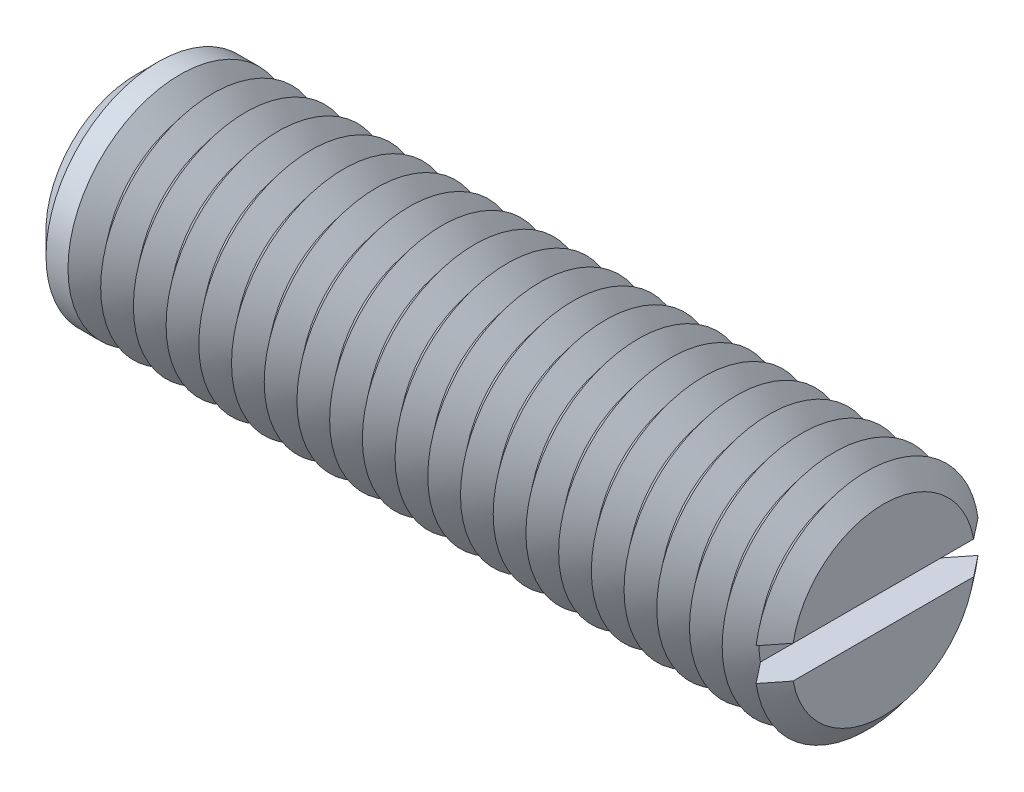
ISO-10303-21;
HEADER;
FILE_DESCRIPTION(('STEP AP214'),'2;1');
FILE_NAME('part.step','',(''),(''),'','','');
FILE_SCHEMA(('AUTOMOTIVE_DESIGN { 1 0 10303 214 1 1 1 1 }'));
ENDSEC;
DATA;
#1=APPLICATION_CONTEXT('core data for automotive mechanical design processes');
#2=APPLICATION_PROTOCOL_DEFINITION('international standard','automotive_design',2000,#1);
#3=PRODUCT_CONTEXT('',#1,'mechanical');
#4=PRODUCT('Part','Part','',(#3));
#5=PRODUCT_RELATED_PRODUCT_CATEGORY('part','',(#4));
#6=PRODUCT_DEFINITION_FORMATION('','',#4);
#7=PRODUCT_DEFINITION_CONTEXT('part definition',#1,'design');
#8=PRODUCT_DEFINITION('design','',#6,#7);
#9=PRODUCT_DEFINITION_SHAPE('','',#8);
#10=(LENGTH_UNIT() NAMED_UNIT(*) SI_UNIT(.MILLI.,.METRE.));
#11=(NAMED_UNIT(*) PLANE_ANGLE_UNIT() SI_UNIT($,.RADIAN.));
#12=(NAMED_UNIT(*) SI_UNIT($,.STERADIAN.) SOLID_ANGLE_UNIT());
#13=UNCERTAINTY_MEASURE_WITH_UNIT(LENGTH_MEASURE(1.E-05),#10,'distance_accuracy_value','');
#14=(GEOMETRIC_REPRESENTATION_CONTEXT(3) GLOBAL_UNCERTAINTY_ASSIGNED_CONTEXT((#13)) GLOBAL_UNIT_ASSIGNED_CONTEXT((#10,
#11,#12)) REPRESENTATION_CONTEXT('',''));
#15=CARTESIAN_POINT('',(0.,0.,0.));
#16=DIRECTION('',(0.,0.,1.));
#17=DIRECTION('',(1.,0.,0.));
#18=AXIS2_PLACEMENT_3D('',#15,#16,#17);
#19=CARTESIAN_POINT('',(19.125,0.,0.));
#20=DIRECTION('',(1.,0.,0.));
#21=DIRECTION('',(0.,0.,-1.));
#22=AXIS2_PLACEMENT_3D('',#19,#20,#21);
#23=CONICAL_SURFACE('',#22,6.,0.895664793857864);
#24=CARTESIAN_POINT('',(19.125,0.,0.));
#25=DIRECTION('',(-1.,0.,0.));
#26=DIRECTION('',(0.,0.,1.));
#27=AXIS2_PLACEMENT_3D('',#24,#25,#26);
#28=CIRCLE('',#27,6.);
#29=CARTESIAN_POINT('',(19.125,-0.875,-5.93585503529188));
#30=VERTEX_POINT('',#29);
#31=CARTESIAN_POINT('',(19.125,-0.875,5.93585503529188));
#32=VERTEX_POINT('',#31);
#33=EDGE_CURVE('E117',#30,#32,#28,.T.);
#34=ORIENTED_EDGE('',*,*,#33,.T.);
#35=CARTESIAN_POINT('',(24.815666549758,-0.875,-13.0784023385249));
#36=CARTESIAN_POINT('',(24.4425848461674,-0.875,-12.6113718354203));
#37=CARTESIAN_POINT('',(24.0695485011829,-0.875,-12.1443050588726));
#38=CARTESIAN_POINT('',(23.3235952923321,-0.875,-11.2100035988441));
#39=CARTESIAN_POINT('',(22.9506784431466,-0.875,-10.7427689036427));
#40=CARTESIAN_POINT('',(22.2043910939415,-0.875,-9.80728158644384));
#41=CARTESIAN_POINT('',(21.831020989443,-0.875,-9.33902864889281));
#42=CARTESIAN_POINT('',(21.084654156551,-0.875,-8.40229688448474));
#43=CARTESIAN_POINT('',(20.7116573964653,-0.875,-7.93381808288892));
#44=CARTESIAN_POINT('',(20.1431910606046,-0.875,-7.21894008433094));
#45=CARTESIAN_POINT('',(19.9475150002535,-0.875,-6.97270509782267));
#46=CARTESIAN_POINT('',(19.5563780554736,-0.875,-6.48006014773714));
#47=CARTESIAN_POINT('',(19.3609171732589,-0.875,-6.23365018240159));
#48=CARTESIAN_POINT('',(18.9702437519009,-0.875,-5.74051596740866));
#49=CARTESIAN_POINT('',(18.775031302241,-0.875,-5.49379164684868));
#50=CARTESIAN_POINT('',(18.3850627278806,-0.875,-4.99999724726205));
#51=CARTESIAN_POINT('',(18.1903065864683,-0.875,-4.75292718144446));
#52=CARTESIAN_POINT('',(17.8017454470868,-0.875,-4.25854698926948));
#53=CARTESIAN_POINT('',(17.6079395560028,-0.875,-4.01123756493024));
#54=CARTESIAN_POINT('',(17.2214614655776,-0.875,-3.51567639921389));
#55=CARTESIAN_POINT('',(17.0287894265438,-0.875,-3.26742453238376));
#56=CARTESIAN_POINT('',(16.7415141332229,-0.875,-2.8938270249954));
#57=CARTESIAN_POINT('',(16.6460716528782,-0.875,-2.7691272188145));
#58=CARTESIAN_POINT('',(16.4560120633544,-0.875,-2.51908954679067));
#59=CARTESIAN_POINT('',(16.3613949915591,-0.875,-2.39375165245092));
#60=CARTESIAN_POINT('',(16.1734585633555,-0.875,-2.14215479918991));
#61=CARTESIAN_POINT('',(16.0801388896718,-0.875,-2.01589607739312));
#62=CARTESIAN_POINT('',(15.8955738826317,-0.875,-1.7618740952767));
#63=CARTESIAN_POINT('',(15.8043283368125,-0.875,-1.63411099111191));
#64=CARTESIAN_POINT('',(15.6947335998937,-0.875,-1.47575777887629));
#65=CARTESIAN_POINT('',(15.6745750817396,-0.875,-1.44642115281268));
#66=CARTESIAN_POINT('',(15.6344943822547,-0.875,-1.38758643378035));
#67=CARTESIAN_POINT('',(15.6145722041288,-0.875,-1.35808833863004));
#68=CARTESIAN_POINT('',(15.5552118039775,-0.875,-1.26931303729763));
#69=CARTESIAN_POINT('',(15.5161833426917,-0.875,-1.20976002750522));
#70=CARTESIAN_POINT('',(15.439598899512,-0.875,-1.08955604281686));
#71=CARTESIAN_POINT('',(15.4020457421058,-0.875,-1.02890325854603));
#72=CARTESIAN_POINT('',(15.3292052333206,-0.875,-0.906252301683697));
#73=CARTESIAN_POINT('',(15.2939174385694,-0.875,-0.844254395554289));
#74=CARTESIAN_POINT('',(15.2387563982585,-0.875,-0.74080235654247));
#75=CARTESIAN_POINT('',(15.217869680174,-0.875,-0.699896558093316));
#76=CARTESIAN_POINT('',(15.1780353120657,-0.875,-0.617162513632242));
#77=CARTESIAN_POINT('',(15.1590880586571,-0.875,-0.575334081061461));
#78=CARTESIAN_POINT('',(15.106232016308,-0.875,-0.448426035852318));
#79=CARTESIAN_POINT('',(15.0761075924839,-0.875,-0.361569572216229));
#80=CARTESIAN_POINT('',(15.0472166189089,-0.875,-0.240214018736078));
#81=CARTESIAN_POINT('',(15.0406925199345,-0.875,-0.207555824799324));
#82=CARTESIAN_POINT('',(15.0303887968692,-0.875,-0.14181650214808));
#83=CARTESIAN_POINT('',(15.0266076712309,-0.875,-0.10873561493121));
#84=CARTESIAN_POINT('',(15.0220436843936,-0.875,-0.0424543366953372));
#85=CARTESIAN_POINT('',(15.0212526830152,-0.875,-0.00925451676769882));
#86=CARTESIAN_POINT('',(15.022702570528,-0.875,0.0570804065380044));
#87=CARTESIAN_POINT('',(15.0249438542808,-0.875,0.0902155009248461));
#88=CARTESIAN_POINT('',(15.0331880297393,-0.875,0.164063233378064));
#89=CARTESIAN_POINT('',(15.0399634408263,-0.875,0.204689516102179));
#90=CARTESIAN_POINT('',(15.0573167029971,-0.875,0.285126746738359));
#91=CARTESIAN_POINT('',(15.0678973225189,-0.875,0.324937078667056));
#92=CARTESIAN_POINT('',(15.0921930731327,-0.875,0.403898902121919));
#93=CARTESIAN_POINT('',(15.1059311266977,-0.875,0.443043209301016));
#94=CARTESIAN_POINT('',(15.1357974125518,-0.875,0.520385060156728));
#95=CARTESIAN_POINT('',(15.151925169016,-0.875,0.558582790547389));
#96=CARTESIAN_POINT('',(15.2021457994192,-0.875,0.669991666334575));
#97=CARTESIAN_POINT('',(15.2387706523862,-0.875,0.742052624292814));
#98=CARTESIAN_POINT('',(15.316117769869,-0.875,0.883956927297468));
#99=CARTESIAN_POINT('',(15.3568440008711,-0.875,0.953798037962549));
#100=CARTESIAN_POINT('',(15.4409804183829,-0.875,1.09208391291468));
#101=CARTESIAN_POINT('',(15.4843973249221,-0.875,1.16052456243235));
#102=CARTESIAN_POINT('',(15.5729384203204,-0.875,1.29629435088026));
#103=CARTESIAN_POINT('',(15.618062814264,-0.875,1.36362335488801));
#104=CARTESIAN_POINT('',(15.7096565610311,-0.875,1.49772496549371));
#105=CARTESIAN_POINT('',(15.7561302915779,-0.875,1.56449457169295));
#106=CARTESIAN_POINT('',(15.8499281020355,-0.875,1.69744165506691));
#107=CARTESIAN_POINT('',(15.8972522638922,-0.875,1.76361907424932));
#108=CARTESIAN_POINT('',(15.9924358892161,-0.875,1.89539956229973));
#109=CARTESIAN_POINT('',(16.0402941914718,-0.875,1.96100347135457));
#110=CARTESIAN_POINT('',(16.136481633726,-0.875,2.09186112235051));
#111=CARTESIAN_POINT('',(16.1848107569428,-0.875,2.15711487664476));
#112=CARTESIAN_POINT('',(16.3290907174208,-0.875,2.35079303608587));
#113=CARTESIAN_POINT('',(16.425565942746,-0.875,2.47882657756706));
#114=CARTESIAN_POINT('',(16.6194152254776,-0.875,2.73421191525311));
#115=CARTESIAN_POINT('',(16.716789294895,-0.875,2.86156370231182));
#116=CARTESIAN_POINT('',(17.0098183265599,-0.875,3.24294102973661));
#117=CARTESIAN_POINT('',(17.2063709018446,-0.875,3.49627631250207));
#118=CARTESIAN_POINT('',(17.6008478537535,-0.875,4.00219025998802));
#119=CARTESIAN_POINT('',(17.7987731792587,-0.875,4.25476818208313));
#120=CARTESIAN_POINT('',(18.1953507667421,-0.875,4.75934213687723));
#121=CARTESIAN_POINT('',(18.394003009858,-0.875,5.01133818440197));
#122=CARTESIAN_POINT('',(18.7908446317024,-0.875,5.51379367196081));
#123=CARTESIAN_POINT('',(18.9890318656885,-0.875,5.76425480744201));
#124=CARTESIAN_POINT('',(19.3857195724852,-0.875,6.26493161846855));
#125=CARTESIAN_POINT('',(19.5842200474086,-0.875,6.51514729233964));
#126=CARTESIAN_POINT('',(20.1799499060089,-0.875,7.26541710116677));
#127=CARTESIAN_POINT('',(20.5775028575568,-0.875,7.76521426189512));
#128=CARTESIAN_POINT('',(21.2943115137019,-0.875,8.66550309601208));
#129=CARTESIAN_POINT('',(21.6134832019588,-0.875,9.06606170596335));
#130=CARTESIAN_POINT('',(22.2520581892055,-0.875,9.86704239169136));
#131=CARTESIAN_POINT('',(22.5714615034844,-0.875,10.2674644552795));
#132=CARTESIAN_POINT('',(23.2116162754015,-0.875,11.0697025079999));
#133=CARTESIAN_POINT('',(23.5323682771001,-0.875,11.4715180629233));
#134=CARTESIAN_POINT('',(24.1739570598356,-0.875,12.2750327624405));
#135=CARTESIAN_POINT('',(24.4947938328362,-0.875,12.6767319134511));
#136=CARTESIAN_POINT('',(24.815666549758,-0.875,13.0784023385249));
#137=B_SPLINE_CURVE_WITH_KNOTS('',3,(#35,#36,#37,#38,#39,#40,#41,#42,#43,#44,#45,#46,#47,#48,
#49,#50,#51,#52,#53,#54,#55,#56,#57,#58,#59,#60,#61,#62,#63,#64,#65,#66,#67,#68,#69,#70,#71,#72,
#73,#74,#75,#76,#77,#78,#79,#80,#81,#82,#83,#84,#85,#86,#87,#88,#89,#90,#91,#92,#93,#94,#95,#96,
#97,#98,#99,#100,#101,#102,#103,#104,#105,#106,#107,#108,#109,#110,#111,#112,#113,#114,#115,
#116,#117,#118,#119,#120,#121,#122,#123,#124,#125,#126,#127,#128,#129,#130,#131,#132,#133,#134,
#135,#136),.UNSPECIFIED.,.F.,.F.,(4,2,2,2,2,2,2,2,2,2,2,2,2,2,2,2,2,2,2,2,2,2,2,2,2,2,2,2,2,2,2,
2,2,2,2,2,2,2,2,2,2,2,2,2,2,2,2,2,2,2,4),(0.,1.79325603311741,3.5866820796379,5.38334403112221,
7.17983772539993,8.12338791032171,9.06694771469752,10.0107838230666,10.9545848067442,
11.8971886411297,12.8399226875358,13.3110192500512,13.7821370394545,14.2531375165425,
14.72408952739,14.8308734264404,14.9376587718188,15.1512485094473,15.3652290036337,
15.5791674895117,15.7169026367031,15.8546658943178,16.1289739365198,16.2287885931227,
16.3285485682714,16.4280367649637,16.5275379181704,16.6508760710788,16.7743041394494,
16.8986582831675,17.0229876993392,17.2652294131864,17.5077076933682,17.7508180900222,
17.9939577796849,18.2380016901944,18.4820692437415,18.7256822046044,18.9692865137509,
19.4502162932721,19.9311525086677,20.8930708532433,21.855738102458,22.8183805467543,
23.776545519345,24.7347169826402,26.6505999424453,28.1871088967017,29.7237307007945,
31.2661438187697,32.8084427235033),.UNSPECIFIED.);
#138=CARTESIAN_POINT('',(18.25,-0.875,4.82848363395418));
#139=VERTEX_POINT('',#138);
#140=EDGE_CURVE('E109',#139,#32,#137,.T.);
#141=ORIENTED_EDGE('',*,*,#140,.F.);
#142=CARTESIAN_POINT('',(18.25,0.,0.));
#143=DIRECTION('',(-1.,0.,0.));
#144=DIRECTION('',(0.,0.,1.));
#145=AXIS2_PLACEMENT_3D('',#142,#143,#144);
#146=CIRCLE('',#145,4.90712535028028);
#147=CARTESIAN_POINT('',(18.25,-0.875,-4.82848363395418));
#148=VERTEX_POINT('',#147);
#149=EDGE_CURVE('E392',#148,#139,#146,.T.);
#150=ORIENTED_EDGE('',*,*,#149,.F.);
#151=EDGE_CURVE('E58',#30,#148,#137,.T.);
#152=ORIENTED_EDGE('',*,*,#151,.F.);
#153=EDGE_LOOP('',(#34,#141,#150,#152));
#154=FACE_BOUND('',#153,.T.);
#155=ADVANCED_FACE('F37',(#154),#23,.T.);
#156=CARTESIAN_POINT('',(19.125,0.875,5.93585503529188));
#157=VERTEX_POINT('',#156);
#158=CARTESIAN_POINT('',(19.125,0.875,-5.93585503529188));
#159=VERTEX_POINT('',#158);
#160=EDGE_CURVE('E100',#157,#159,#28,.T.);
#161=ORIENTED_EDGE('',*,*,#160,.T.);
#162=CARTESIAN_POINT('',(24.815666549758,0.875,13.0784023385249));
#163=CARTESIAN_POINT('',(24.4425848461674,0.875,12.6113718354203));
#164=CARTESIAN_POINT('',(24.0695485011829,0.875,12.1443050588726));
#165=CARTESIAN_POINT('',(23.3235952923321,0.875,11.2100035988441));
#166=CARTESIAN_POINT('',(22.9506784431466,0.875,10.7427689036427));
#167=CARTESIAN_POINT('',(22.2043910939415,0.875,9.80728158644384));
#168=CARTESIAN_POINT('',(21.831020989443,0.875,9.33902864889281));
#169=CARTESIAN_POINT('',(21.084654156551,0.875,8.40229688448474));
#170=CARTESIAN_POINT('',(20.7116573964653,0.875,7.93381808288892));
#171=CARTESIAN_POINT('',(20.1431910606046,0.875,7.21894008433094));
#172=CARTESIAN_POINT('',(19.9475150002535,0.875,6.97270509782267));
#173=CARTESIAN_POINT('',(19.5563780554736,0.875,6.48006014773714));
#174=CARTESIAN_POINT('',(19.3609171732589,0.875,6.23365018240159));
#175=CARTESIAN_POINT('',(18.9702437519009,0.875,5.74051596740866));
#176=CARTESIAN_POINT('',(18.775031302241,0.875,5.49379164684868));
#177=CARTESIAN_POINT('',(18.3850627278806,0.875,4.99999724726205));
#178=CARTESIAN_POINT('',(18.1903065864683,0.875,4.75292718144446));
#179=CARTESIAN_POINT('',(17.8017454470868,0.875,4.25854698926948));
#180=CARTESIAN_POINT('',(17.6079395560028,0.875,4.01123756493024));
#181=CARTESIAN_POINT('',(17.2214614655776,0.875,3.51567639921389));
#182=CARTESIAN_POINT('',(17.0287894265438,0.875,3.26742453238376));
#183=CARTESIAN_POINT('',(16.7415141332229,0.875,2.8938270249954));
#184=CARTESIAN_POINT('',(16.6460716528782,0.875,2.7691272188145));
#185=CARTESIAN_POINT('',(16.4560120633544,0.875,2.51908954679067));
#186=CARTESIAN_POINT('',(16.3613949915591,0.875,2.39375165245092));
#187=CARTESIAN_POINT('',(16.1734585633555,0.875,2.14215479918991));
#188=CARTESIAN_POINT('',(16.0801388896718,0.875,2.01589607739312));
#189=CARTESIAN_POINT('',(15.8955738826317,0.875,1.7618740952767));
#190=CARTESIAN_POINT('',(15.8043283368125,0.875,1.63411099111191));
#191=CARTESIAN_POINT('',(15.6947335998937,0.875,1.47575777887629));
#192=CARTESIAN_POINT('',(15.6745750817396,0.875,1.44642115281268));
#193=CARTESIAN_POINT('',(15.6344943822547,0.875,1.38758643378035));
#194=CARTESIAN_POINT('',(15.6145722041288,0.875,1.35808833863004));
#195=CARTESIAN_POINT('',(15.5552118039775,0.875,1.26931303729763));
#196=CARTESIAN_POINT('',(15.5161833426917,0.875,1.20976002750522));
#197=CARTESIAN_POINT('',(15.439598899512,0.875,1.08955604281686));
#198=CARTESIAN_POINT('',(15.4020457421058,0.875,1.02890325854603));
#199=CARTESIAN_POINT('',(15.3292052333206,0.875,0.906252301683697));
#200=CARTESIAN_POINT('',(15.2939174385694,0.875,0.844254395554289));
#201=CARTESIAN_POINT('',(15.2387563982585,0.875,0.74080235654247));
#202=CARTESIAN_POINT('',(15.217869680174,0.875,0.699896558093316));
#203=CARTESIAN_POINT('',(15.1780353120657,0.875,0.617162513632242));
#204=CARTESIAN_POINT('',(15.1590880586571,0.875,0.575334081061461));
#205=CARTESIAN_POINT('',(15.106232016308,0.875,0.448426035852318));
#206=CARTESIAN_POINT('',(15.0761075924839,0.875,0.361569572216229));
#207=CARTESIAN_POINT('',(15.0472166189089,0.875,0.240214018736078));
#208=CARTESIAN_POINT('',(15.0406925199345,0.875,0.207555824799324));
#209=CARTESIAN_POINT('',(15.0303887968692,0.875,0.14181650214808));
#210=CARTESIAN_POINT('',(15.0266076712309,0.875,0.10873561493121));
#211=CARTESIAN_POINT('',(15.0220436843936,0.875,0.0424543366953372));
#212=CARTESIAN_POINT('',(15.0212526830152,0.875,0.00925451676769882));
#213=CARTESIAN_POINT('',(15.022702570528,0.875,-0.0570804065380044));
#214=CARTESIAN_POINT('',(15.0249438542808,0.875,-0.0902155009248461));
#215=CARTESIAN_POINT('',(15.0331880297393,0.875,-0.164063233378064));
#216=CARTESIAN_POINT('',(15.0399634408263,0.875,-0.204689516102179));
#217=CARTESIAN_POINT('',(15.0573167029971,0.875,-0.285126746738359));
#218=CARTESIAN_POINT('',(15.0678973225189,0.875,-0.324937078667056));
#219=CARTESIAN_POINT('',(15.0921930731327,0.875,-0.403898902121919));
#220=CARTESIAN_POINT('',(15.1059311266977,0.875,-0.443043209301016));
#221=CARTESIAN_POINT('',(15.1357974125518,0.875,-0.520385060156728));
#222=CARTESIAN_POINT('',(15.151925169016,0.875,-0.558582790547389));
#223=CARTESIAN_POINT('',(15.2021457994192,0.875,-0.669991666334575));
#224=CARTESIAN_POINT('',(15.2387706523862,0.875,-0.742052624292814));
#225=CARTESIAN_POINT('',(15.316117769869,0.875,-0.883956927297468));
#226=CARTESIAN_POINT('',(15.3568440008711,0.875,-0.953798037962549));
#227=CARTESIAN_POINT('',(15.4409804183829,0.875,-1.09208391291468));
#228=CARTESIAN_POINT('',(15.4843973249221,0.875,-1.16052456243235));
#229=CARTESIAN_POINT('',(15.5729384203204,0.875,-1.29629435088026));
#230=CARTESIAN_POINT('',(15.618062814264,0.875,-1.36362335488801));
#231=CARTESIAN_POINT('',(15.7096565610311,0.875,-1.49772496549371));
#232=CARTESIAN_POINT('',(15.7561302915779,0.875,-1.56449457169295));
#233=CARTESIAN_POINT('',(15.8499281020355,0.875,-1.69744165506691));
#234=CARTESIAN_POINT('',(15.8972522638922,0.875,-1.76361907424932));
#235=CARTESIAN_POINT('',(15.9924358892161,0.875,-1.89539956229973));
#236=CARTESIAN_POINT('',(16.0402941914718,0.875,-1.96100347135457));
#237=CARTESIAN_POINT('',(16.136481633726,0.875,-2.09186112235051));
#238=CARTESIAN_POINT('',(16.1848107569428,0.875,-2.15711487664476));
#239=CARTESIAN_POINT('',(16.3290907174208,0.875,-2.35079303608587));
#240=CARTESIAN_POINT('',(16.425565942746,0.875,-2.47882657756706));
#241=CARTESIAN_POINT('',(16.6194152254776,0.875,-2.73421191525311));
#242=CARTESIAN_POINT('',(16.716789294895,0.875,-2.86156370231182));
#243=CARTESIAN_POINT('',(17.0098183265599,0.875,-3.24294102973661));
#244=CARTESIAN_POINT('',(17.2063709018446,0.875,-3.49627631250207));
#245=CARTESIAN_POINT('',(17.6008478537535,0.875,-4.00219025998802));
#246=CARTESIAN_POINT('',(17.7987731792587,0.875,-4.25476818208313));
#247=CARTESIAN_POINT('',(18.1953507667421,0.875,-4.75934213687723));
#248=CARTESIAN_POINT('',(18.394003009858,0.875,-5.01133818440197));
#249=CARTESIAN_POINT('',(18.7908446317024,0.875,-5.51379367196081));
#250=CARTESIAN_POINT('',(18.9890318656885,0.875,-5.76425480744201));
#251=CARTESIAN_POINT('',(19.3857195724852,0.875,-6.26493161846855));
#252=CARTESIAN_POINT('',(19.5842200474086,0.875,-6.51514729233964));
#253=CARTESIAN_POINT('',(20.1799499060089,0.875,-7.26541710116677));
#254=CARTESIAN_POINT('',(20.5775028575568,0.875,-7.76521426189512));
#255=CARTESIAN_POINT('',(21.2943115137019,0.875,-8.66550309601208));
#256=CARTESIAN_POINT('',(21.6134832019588,0.875,-9.06606170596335));
#257=CARTESIAN_POINT('',(22.2520581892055,0.875,-9.86704239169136));
#258=CARTESIAN_POINT('',(22.5714615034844,0.875,-10.2674644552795));
#259=CARTESIAN_POINT('',(23.2116162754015,0.875,-11.0697025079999));
#260=CARTESIAN_POINT('',(23.5323682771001,0.875,-11.4715180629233));
#261=CARTESIAN_POINT('',(24.1739570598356,0.875,-12.2750327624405));
#262=CARTESIAN_POINT('',(24.4947938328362,0.875,-12.6767319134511));
#263=CARTESIAN_POINT('',(24.815666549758,0.875,-13.0784023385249));
#264=B_SPLINE_CURVE_WITH_KNOTS('',3,(#162,#163,#164,#165,#166,#167,#168,#169,#170,#171,#172,
#173,#174,#175,#176,#177,#178,#179,#180,#181,#182,#183,#184,#185,#186,#187,#188,#189,#190,#191,
#192,#193,#194,#195,#196,#197,#198,#199,#200,#201,#202,#203,#204,#205,#206,#207,#208,#209,#210,
#211,#212,#213,#214,#215,#216,#217,#218,#219,#220,#221,#222,#223,#224,#225,#226,#227,#228,#229,
#230,#231,#232,#233,#234,#235,#236,#237,#238,#239,#240,#241,#242,#243,#244,#245,#246,#247,#248,
#249,#250,#251,#252,#253,#254,#255,#256,#257,#258,#259,#260,#261,#262,#263),.UNSPECIFIED.,.F.,
.F.,(4,2,2,2,2,2,2,2,2,2,2,2,2,2,2,2,2,2,2,2,2,2,2,2,2,2,2,2,2,2,2,2,2,2,2,2,2,2,2,2,2,2,2,2,2,
2,2,2,2,2,4),(0.,1.79325603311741,3.5866820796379,5.38334403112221,7.17983772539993,
8.12338791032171,9.06694771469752,10.0107838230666,10.9545848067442,11.8971886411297,
12.8399226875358,13.3110192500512,13.7821370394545,14.2531375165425,14.72408952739,
14.8308734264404,14.9376587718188,15.1512485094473,15.3652290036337,15.5791674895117,
15.7169026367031,15.8546658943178,16.1289739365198,16.2287885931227,16.3285485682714,
16.4280367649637,16.5275379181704,16.6508760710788,16.7743041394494,16.8986582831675,
17.0229876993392,17.2652294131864,17.5077076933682,17.7508180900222,17.9939577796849,
18.2380016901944,18.4820692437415,18.7256822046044,18.9692865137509,19.4502162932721,
19.9311525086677,20.8930708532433,21.855738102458,22.8183805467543,23.776545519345,
24.7347169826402,26.6505999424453,28.1871088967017,29.7237307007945,31.2661438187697,
32.8084427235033),.UNSPECIFIED.);
#265=CARTESIAN_POINT('',(18.25,0.875,-4.82848363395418));
#266=VERTEX_POINT('',#265);
#267=EDGE_CURVE('E110',#266,#159,#264,.T.);
#268=ORIENTED_EDGE('',*,*,#267,.F.);
#269=CARTESIAN_POINT('',(18.25,0.875,4.82848363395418));
#270=VERTEX_POINT('',#269);
#271=EDGE_CURVE('E103',#270,#266,#146,.T.);
#272=ORIENTED_EDGE('',*,*,#271,.F.);
#273=EDGE_CURVE('E97',#157,#270,#264,.T.);
#274=ORIENTED_EDGE('',*,*,#273,.F.);
#275=EDGE_LOOP('',(#161,#268,#272,#274));
#276=FACE_BOUND('',#275,.T.);
#277=ADVANCED_FACE('F99',(#276),#23,.T.);
#278=CARTESIAN_POINT('',(18.25,0.,0.));
#279=DIRECTION('',(-1.,0.,0.));
#280=DIRECTION('',(0.,0.,1.));
#281=AXIS2_PLACEMENT_3D('',#278,#279,#280);
#282=CONICAL_SURFACE('',#281,4.90712535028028,0.895664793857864);
#283=CARTESIAN_POINT('',(17.375,0.,0.));
#284=DIRECTION('',(-1.,0.,0.));
#285=DIRECTION('',(0.,0.,1.));
#286=AXIS2_PLACEMENT_3D('',#283,#284,#285);
#287=CIRCLE('',#286,6.);
#288=CARTESIAN_POINT('',(17.375,0.,6.));
#289=VERTEX_POINT('',#288);
#290=EDGE_CURVE('E380',#289,#289,#287,.T.);
#291=ORIENTED_EDGE('',*,*,#290,.F.);
#292=EDGE_LOOP('',(#291));
#293=FACE_BOUND('',#292,.T.);
#294=ORIENTED_EDGE('',*,*,#271,.T.);
#295=EDGE_CURVE('E387',#266,#148,#146,.T.);
#296=ORIENTED_EDGE('',*,*,#295,.T.);
#297=ORIENTED_EDGE('',*,*,#149,.T.);
#298=EDGE_CURVE('E386',#139,#270,#146,.T.);
#299=ORIENTED_EDGE('',*,*,#298,.T.);
#300=EDGE_LOOP('',(#294,#296,#297,#299));
#301=FACE_BOUND('',#300,.T.);
#302=ADVANCED_FACE('F167',(#293,#301),#282,.T.);
#303=CARTESIAN_POINT('',(20.,0.,0.));
#304=DIRECTION('',(1.,0.,0.));
#305=DIRECTION('',(0.,0.,-1.));
#306=AXIS2_PLACEMENT_3D('',#303,#304,#305);
#307=PLANE('',#306);
#308=CARTESIAN_POINT('',(20.,0.,0.));
#309=DIRECTION('',(-1.,0.,0.));
#310=DIRECTION('',(0.,0.,1.));
#311=AXIS2_PLACEMENT_3D('',#308,#309,#310);
#312=CIRCLE('',#311,4.90712535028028);
#313=CARTESIAN_POINT('',(20.,0.875,4.82848363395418));
#314=VERTEX_POINT('',#313);
#315=CARTESIAN_POINT('',(20.,0.875,-4.82848363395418));
#316=VERTEX_POINT('',#315);
#317=EDGE_CURVE('E159',#314,#316,#312,.T.);
#318=ORIENTED_EDGE('',*,*,#317,.F.);
#319=DIRECTION('',(0.,0.,1.));
#320=VECTOR('',#319,1.);
#321=CARTESIAN_POINT('',(20.,0.875,0.));
#322=LINE('',#321,#320);
#323=EDGE_CURVE('E122',#316,#314,#322,.T.);
#324=ORIENTED_EDGE('',*,*,#323,.F.);
#325=EDGE_LOOP('',(#318,#324));
#326=FACE_BOUND('',#325,.T.);
#327=ADVANCED_FACE('F171',(#326),#307,.T.);
#328=CARTESIAN_POINT('',(20.,-0.875,-4.82848363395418));
#329=VERTEX_POINT('',#328);
#330=CARTESIAN_POINT('',(20.,-0.875,4.82848363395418));
#331=VERTEX_POINT('',#330);
#332=EDGE_CURVE('E66',#329,#331,#312,.T.);
#333=ORIENTED_EDGE('',*,*,#332,.F.);
#334=DIRECTION('',(0.,0.,-1.));
#335=VECTOR('',#334,1.);
#336=CARTESIAN_POINT('',(20.,-0.875,0.));
#337=LINE('',#336,#335);
#338=EDGE_CURVE('E135',#331,#329,#337,.T.);
#339=ORIENTED_EDGE('',*,*,#338,.F.);
#340=EDGE_LOOP('',(#333,#339));
#341=FACE_BOUND('',#340,.T.);
#342=ADVANCED_FACE('F200',(#341),#307,.T.);
#343=CARTESIAN_POINT('',(20.,0.,0.));
#344=DIRECTION('',(-1.,0.,0.));
#345=DIRECTION('',(0.,0.,1.));
#346=AXIS2_PLACEMENT_3D('',#343,#344,#345);
#347=CONICAL_SURFACE('',#346,4.90712535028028,0.895664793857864);
#348=ORIENTED_EDGE('',*,*,#160,.F.);
#349=CARTESIAN_POINT('',(13.434333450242,0.875,-13.0784023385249));
#350=CARTESIAN_POINT('',(13.8074151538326,0.875,-12.6113718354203));
#351=CARTESIAN_POINT('',(14.1804514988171,0.875,-12.1443050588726));
#352=CARTESIAN_POINT('',(14.9264047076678,0.875,-11.2100035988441));
#353=CARTESIAN_POINT('',(15.2993215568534,0.875,-10.7427689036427));
#354=CARTESIAN_POINT('',(16.0456089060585,0.875,-9.80728158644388));
#355=CARTESIAN_POINT('',(16.4189790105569,0.875,-9.33902864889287));
#356=CARTESIAN_POINT('',(17.1653458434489,0.875,-8.40229688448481));
#357=CARTESIAN_POINT('',(17.5383426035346,0.875,-7.93381808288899));
#358=CARTESIAN_POINT('',(18.1068089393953,0.875,-7.21894008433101));
#359=CARTESIAN_POINT('',(18.3024849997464,0.875,-6.97270509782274));
#360=CARTESIAN_POINT('',(18.6936219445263,0.875,-6.48006014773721));
#361=CARTESIAN_POINT('',(18.889082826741,0.875,-6.23365018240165));
#362=CARTESIAN_POINT('',(19.2797562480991,0.875,-5.74051596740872));
#363=CARTESIAN_POINT('',(19.4749686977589,0.875,-5.49379164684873));
#364=CARTESIAN_POINT('',(19.8649372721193,0.875,-4.9999972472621));
#365=CARTESIAN_POINT('',(20.0596934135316,0.875,-4.7529271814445));
#366=CARTESIAN_POINT('',(20.4482545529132,0.875,-4.25854698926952));
#367=CARTESIAN_POINT('',(20.6420604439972,0.875,-4.01123756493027));
#368=CARTESIAN_POINT('',(21.0285385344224,0.875,-3.51567639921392));
#369=CARTESIAN_POINT('',(21.2212105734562,0.875,-3.26742453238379));
#370=CARTESIAN_POINT('',(21.5084858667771,0.875,-2.89382702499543));
#371=CARTESIAN_POINT('',(21.6039283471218,0.875,-2.76912721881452));
#372=CARTESIAN_POINT('',(21.7939879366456,0.875,-2.51908954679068));
#373=CARTESIAN_POINT('',(21.8886050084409,0.875,-2.39375165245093));
#374=CARTESIAN_POINT('',(22.0765414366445,0.875,-2.14215479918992));
#375=CARTESIAN_POINT('',(22.1698611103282,0.875,-2.01589607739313));
#376=CARTESIAN_POINT('',(22.3544261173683,0.875,-1.76187409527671));
#377=CARTESIAN_POINT('',(22.4456716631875,0.875,-1.63411099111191));
#378=CARTESIAN_POINT('',(22.5552664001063,0.875,-1.47575777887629));
#379=CARTESIAN_POINT('',(22.5754249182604,0.875,-1.44642115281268));
#380=CARTESIAN_POINT('',(22.6155056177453,0.875,-1.38758643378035));
#381=CARTESIAN_POINT('',(22.6354277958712,0.875,-1.35808833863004));
#382=CARTESIAN_POINT('',(22.6947881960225,0.875,-1.26931303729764));
#383=CARTESIAN_POINT('',(22.7338166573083,0.875,-1.20976002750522));
#384=CARTESIAN_POINT('',(22.810401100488,0.875,-1.08955604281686));
#385=CARTESIAN_POINT('',(22.8479542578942,0.875,-1.02890325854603));
#386=CARTESIAN_POINT('',(22.9207947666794,0.875,-0.906252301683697));
#387=CARTESIAN_POINT('',(22.9560825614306,0.875,-0.844254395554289));
#388=CARTESIAN_POINT('',(23.0112436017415,0.875,-0.74080235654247));
#389=CARTESIAN_POINT('',(23.032130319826,0.875,-0.699896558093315));
#390=CARTESIAN_POINT('',(23.0719646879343,0.875,-0.61716251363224));
#391=CARTESIAN_POINT('',(23.0909119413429,0.875,-0.57533408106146));
#392=CARTESIAN_POINT('',(23.143767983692,0.875,-0.448426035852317));
#393=CARTESIAN_POINT('',(23.1738924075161,0.875,-0.361569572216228));
#394=CARTESIAN_POINT('',(23.2027833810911,0.875,-0.240214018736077));
#395=CARTESIAN_POINT('',(23.2093074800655,0.875,-0.207555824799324));
#396=CARTESIAN_POINT('',(23.2196112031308,0.875,-0.141816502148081));
#397=CARTESIAN_POINT('',(23.2233923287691,0.875,-0.108735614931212));
#398=CARTESIAN_POINT('',(23.2279563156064,0.875,-0.0424543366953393));
#399=CARTESIAN_POINT('',(23.2287473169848,0.875,-0.00925451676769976));
#400=CARTESIAN_POINT('',(23.227297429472,0.875,0.0570804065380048));
#401=CARTESIAN_POINT('',(23.2250561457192,0.875,0.0902155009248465));
#402=CARTESIAN_POINT('',(23.2168119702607,0.875,0.164063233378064));
#403=CARTESIAN_POINT('',(23.2100365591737,0.875,0.204689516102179));
#404=CARTESIAN_POINT('',(23.1926832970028,0.875,0.28512674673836));
#405=CARTESIAN_POINT('',(23.1821026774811,0.875,0.324937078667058));
#406=CARTESIAN_POINT('',(23.1578069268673,0.875,0.403898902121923));
#407=CARTESIAN_POINT('',(23.1440688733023,0.875,0.443043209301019));
#408=CARTESIAN_POINT('',(23.1142025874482,0.875,0.520385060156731));
#409=CARTESIAN_POINT('',(23.098074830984,0.875,0.558582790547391));
#410=CARTESIAN_POINT('',(23.0478542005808,0.875,0.669991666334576));
#411=CARTESIAN_POINT('',(23.0112293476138,0.875,0.742052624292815));
#412=CARTESIAN_POINT('',(22.933882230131,0.875,0.88395692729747));
#413=CARTESIAN_POINT('',(22.8931559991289,0.875,0.953798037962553));
#414=CARTESIAN_POINT('',(22.8090195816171,0.875,1.09208391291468));
#415=CARTESIAN_POINT('',(22.7656026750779,0.875,1.16052456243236));
#416=CARTESIAN_POINT('',(22.6770615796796,0.875,1.29629435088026));
#417=CARTESIAN_POINT('',(22.631937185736,0.875,1.36362335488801));
#418=CARTESIAN_POINT('',(22.5403434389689,0.875,1.49772496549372));
#419=CARTESIAN_POINT('',(22.4938697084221,0.875,1.56449457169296));
#420=CARTESIAN_POINT('',(22.4000718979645,0.875,1.69744165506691));
#421=CARTESIAN_POINT('',(22.3527477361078,0.875,1.76361907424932));
#422=CARTESIAN_POINT('',(22.2575641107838,0.875,1.89539956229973));
#423=CARTESIAN_POINT('',(22.2097058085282,0.875,1.96100347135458));
#424=CARTESIAN_POINT('',(22.113518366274,0.875,2.09186112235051));
#425=CARTESIAN_POINT('',(22.0651892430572,0.875,2.15711487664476));
#426=CARTESIAN_POINT('',(21.9209092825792,0.875,2.35079303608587));
#427=CARTESIAN_POINT('',(21.824434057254,0.875,2.47882657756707));
#428=CARTESIAN_POINT('',(21.6305847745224,0.875,2.73421191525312));
#429=CARTESIAN_POINT('',(21.533210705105,0.875,2.86156370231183));
#430=CARTESIAN_POINT('',(21.2401816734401,0.875,3.24294102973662));
#431=CARTESIAN_POINT('',(21.0436290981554,0.875,3.49627631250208));
#432=CARTESIAN_POINT('',(20.6491521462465,0.875,4.00219025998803));
#433=CARTESIAN_POINT('',(20.4512268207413,0.875,4.25476818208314));
#434=CARTESIAN_POINT('',(20.0546492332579,0.875,4.75934213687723));
#435=CARTESIAN_POINT('',(19.855996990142,0.875,5.01133818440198));
#436=CARTESIAN_POINT('',(19.4591553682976,0.875,5.51379367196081));
#437=CARTESIAN_POINT('',(19.2609681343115,0.875,5.76425480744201));
#438=CARTESIAN_POINT('',(18.8642804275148,0.875,6.26493161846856));
#439=CARTESIAN_POINT('',(18.6657799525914,0.875,6.51514729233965));
#440=CARTESIAN_POINT('',(18.0700500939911,0.875,7.26541710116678));
#441=CARTESIAN_POINT('',(17.6724971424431,0.875,7.76521426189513));
#442=CARTESIAN_POINT('',(16.9556884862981,0.875,8.66550309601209));
#443=CARTESIAN_POINT('',(16.6365167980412,0.875,9.06606170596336));
#444=CARTESIAN_POINT('',(15.9979418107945,0.875,9.86704239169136));
#445=CARTESIAN_POINT('',(15.6785384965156,0.875,10.2674644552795));
#446=CARTESIAN_POINT('',(15.0383837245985,0.875,11.0697025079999));
#447=CARTESIAN_POINT('',(14.7176317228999,0.875,11.4715180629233));
#448=CARTESIAN_POINT('',(14.0760429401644,0.875,12.2750327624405));
#449=CARTESIAN_POINT('',(13.7552061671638,0.875,12.6767319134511));
#450=CARTESIAN_POINT('',(13.434333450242,0.875,13.0784023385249));
#451=B_SPLINE_CURVE_WITH_KNOTS('',3,(#349,#350,#351,#352,#353,#354,#355,#356,#357,#358,#359,
#360,#361,#362,#363,#364,#365,#366,#367,#368,#369,#370,#371,#372,#373,#374,#375,#376,#377,#378,
#379,#380,#381,#382,#383,#384,#385,#386,#387,#388,#389,#390,#391,#392,#393,#394,#395,#396,#397,
#398,#399,#400,#401,#402,#403,#404,#405,#406,#407,#408,#409,#410,#411,#412,#413,#414,#415,#416,
#417,#418,#419,#420,#421,#422,#423,#424,#425,#426,#427,#428,#429,#430,#431,#432,#433,#434,#435,
#436,#437,#438,#439,#440,#441,#442,#443,#444,#445,#446,#447,#448,#449,#450),.UNSPECIFIED.,.F.,
.F.,(4,2,2,2,2,2,2,2,2,2,2,2,2,2,2,2,2,2,2,2,2,2,2,2,2,2,2,2,2,2,2,2,2,2,2,2,2,2,2,2,2,2,2,2,2,
2,2,2,2,2,4),(0.,1.79325603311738,3.58668207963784,5.38334403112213,7.17983772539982,
8.12338791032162,9.06694771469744,10.0107838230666,10.9545848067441,11.8971886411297,
12.8399226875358,13.3110192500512,13.7821370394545,14.2531375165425,14.72408952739,
14.8308734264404,14.9376587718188,15.1512485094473,15.3652290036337,15.5791674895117,
15.7169026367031,15.8546658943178,16.1289739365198,16.2287885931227,16.3285485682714,
16.4280367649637,16.5275379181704,16.6508760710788,16.7743041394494,16.8986582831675,
17.0229876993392,17.2652294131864,17.5077076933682,17.7508180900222,17.9939577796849,
18.2380016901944,18.4820692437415,18.7256822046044,18.9692865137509,19.4502162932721,
19.9311525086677,20.8930708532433,21.855738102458,22.8183805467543,23.7765455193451,
24.7347169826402,26.6505999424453,28.1871088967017,29.7237307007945,31.2661438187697,
32.8084427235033),.UNSPECIFIED.);
#452=EDGE_CURVE('E41',#314,#157,#451,.T.);
#453=ORIENTED_EDGE('',*,*,#452,.F.);
#454=ORIENTED_EDGE('',*,*,#317,.T.);
#455=EDGE_CURVE('E11',#159,#316,#451,.T.);
#456=ORIENTED_EDGE('',*,*,#455,.F.);
#457=EDGE_LOOP('',(#348,#453,#454,#456));
#458=FACE_BOUND('',#457,.T.);
#459=ADVANCED_FACE('F114',(#458),#347,.T.);
#460=CARTESIAN_POINT('',(20.,0.875,-9.));
#461=DIRECTION('',(0.,1.,0.));
#462=DIRECTION('',(0.,0.,1.));
#463=AXIS2_PLACEMENT_3D('',#460,#461,#462);
#464=PLANE('',#463);
#465=ORIENTED_EDGE('',*,*,#452,.T.);
#466=ORIENTED_EDGE('',*,*,#273,.T.);
#467=DIRECTION('',(0.,0.,1.));
#468=VECTOR('',#467,1.);
#469=CARTESIAN_POINT('',(18.25,0.875,-9.));
#470=LINE('',#469,#468);
#471=EDGE_CURVE('E144',#266,#270,#470,.T.);
#472=ORIENTED_EDGE('',*,*,#471,.F.);
#473=ORIENTED_EDGE('',*,*,#267,.T.);
#474=ORIENTED_EDGE('',*,*,#455,.T.);
#475=ORIENTED_EDGE('',*,*,#323,.T.);
#476=EDGE_LOOP('',(#465,#466,#472,#473,#474,#475));
#477=FACE_BOUND('',#476,.T.);
#478=ADVANCED_FACE('F120',(#477),#464,.F.);
#479=ORIENTED_EDGE('',*,*,#33,.F.);
#480=CARTESIAN_POINT('',(13.434333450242,-0.875,13.0784023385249));
#481=CARTESIAN_POINT('',(13.8074151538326,-0.875,12.6113718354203));
#482=CARTESIAN_POINT('',(14.1804514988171,-0.875,12.1443050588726));
#483=CARTESIAN_POINT('',(14.9264047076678,-0.875,11.2100035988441));
#484=CARTESIAN_POINT('',(15.2993215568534,-0.875,10.7427689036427));
#485=CARTESIAN_POINT('',(16.0456089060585,-0.875,9.80728158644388));
#486=CARTESIAN_POINT('',(16.4189790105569,-0.875,9.33902864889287));
#487=CARTESIAN_POINT('',(17.1653458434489,-0.875,8.40229688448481));
#488=CARTESIAN_POINT('',(17.5383426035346,-0.875,7.93381808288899));
#489=CARTESIAN_POINT('',(18.1068089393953,-0.875,7.21894008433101));
#490=CARTESIAN_POINT('',(18.3024849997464,-0.875,6.97270509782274));
#491=CARTESIAN_POINT('',(18.6936219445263,-0.875,6.48006014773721));
#492=CARTESIAN_POINT('',(18.889082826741,-0.875,6.23365018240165));
#493=CARTESIAN_POINT('',(19.2797562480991,-0.875,5.74051596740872));
#494=CARTESIAN_POINT('',(19.4749686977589,-0.875,5.49379164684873));
#495=CARTESIAN_POINT('',(19.8649372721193,-0.875,4.9999972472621));
#496=CARTESIAN_POINT('',(20.0596934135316,-0.875,4.7529271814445));
#497=CARTESIAN_POINT('',(20.4482545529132,-0.875,4.25854698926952));
#498=CARTESIAN_POINT('',(20.6420604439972,-0.875,4.01123756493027));
#499=CARTESIAN_POINT('',(21.0285385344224,-0.875,3.51567639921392));
#500=CARTESIAN_POINT('',(21.2212105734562,-0.875,3.26742453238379));
#501=CARTESIAN_POINT('',(21.5084858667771,-0.875,2.89382702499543));
#502=CARTESIAN_POINT('',(21.6039283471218,-0.875,2.76912721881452));
#503=CARTESIAN_POINT('',(21.7939879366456,-0.875,2.51908954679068));
#504=CARTESIAN_POINT('',(21.8886050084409,-0.875,2.39375165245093));
#505=CARTESIAN_POINT('',(22.0765414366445,-0.875,2.14215479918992));
#506=CARTESIAN_POINT('',(22.1698611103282,-0.875,2.01589607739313));
#507=CARTESIAN_POINT('',(22.3544261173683,-0.875,1.76187409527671));
#508=CARTESIAN_POINT('',(22.4456716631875,-0.875,1.63411099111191));
#509=CARTESIAN_POINT('',(22.5552664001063,-0.875,1.47575777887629));
#510=CARTESIAN_POINT('',(22.5754249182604,-0.875,1.44642115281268));
#511=CARTESIAN_POINT('',(22.6155056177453,-0.875,1.38758643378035));
#512=CARTESIAN_POINT('',(22.6354277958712,-0.875,1.35808833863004));
#513=CARTESIAN_POINT('',(22.6947881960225,-0.875,1.26931303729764));
#514=CARTESIAN_POINT('',(22.7338166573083,-0.875,1.20976002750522));
#515=CARTESIAN_POINT('',(22.810401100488,-0.875,1.08955604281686));
#516=CARTESIAN_POINT('',(22.8479542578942,-0.875,1.02890325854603));
#517=CARTESIAN_POINT('',(22.9207947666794,-0.875,0.906252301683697));
#518=CARTESIAN_POINT('',(22.9560825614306,-0.875,0.844254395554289));
#519=CARTESIAN_POINT('',(23.0112436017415,-0.875,0.74080235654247));
#520=CARTESIAN_POINT('',(23.032130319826,-0.875,0.699896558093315));
#521=CARTESIAN_POINT('',(23.0719646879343,-0.875,0.61716251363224));
#522=CARTESIAN_POINT('',(23.0909119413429,-0.875,0.57533408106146));
#523=CARTESIAN_POINT('',(23.143767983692,-0.875,0.448426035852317));
#524=CARTESIAN_POINT('',(23.1738924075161,-0.875,0.361569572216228));
#525=CARTESIAN_POINT('',(23.2027833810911,-0.875,0.240214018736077));
#526=CARTESIAN_POINT('',(23.2093074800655,-0.875,0.207555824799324));
#527=CARTESIAN_POINT('',(23.2196112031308,-0.875,0.141816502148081));
#528=CARTESIAN_POINT('',(23.2233923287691,-0.875,0.108735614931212));
#529=CARTESIAN_POINT('',(23.2279563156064,-0.875,0.0424543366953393));
#530=CARTESIAN_POINT('',(23.2287473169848,-0.875,0.00925451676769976));
#531=CARTESIAN_POINT('',(23.227297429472,-0.875,-0.0570804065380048));
#532=CARTESIAN_POINT('',(23.2250561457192,-0.875,-0.0902155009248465));
#533=CARTESIAN_POINT('',(23.2168119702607,-0.875,-0.164063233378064));
#534=CARTESIAN_POINT('',(23.2100365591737,-0.875,-0.204689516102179));
#535=CARTESIAN_POINT('',(23.1926832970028,-0.875,-0.28512674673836));
#536=CARTESIAN_POINT('',(23.1821026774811,-0.875,-0.324937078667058));
#537=CARTESIAN_POINT('',(23.1578069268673,-0.875,-0.403898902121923));
#538=CARTESIAN_POINT('',(23.1440688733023,-0.875,-0.443043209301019));
#539=CARTESIAN_POINT('',(23.1142025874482,-0.875,-0.520385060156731));
#540=CARTESIAN_POINT('',(23.098074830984,-0.875,-0.558582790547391));
#541=CARTESIAN_POINT('',(23.0478542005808,-0.875,-0.669991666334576));
#542=CARTESIAN_POINT('',(23.0112293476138,-0.875,-0.742052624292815));
#543=CARTESIAN_POINT('',(22.933882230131,-0.875,-0.88395692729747));
#544=CARTESIAN_POINT('',(22.8931559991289,-0.875,-0.953798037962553));
#545=CARTESIAN_POINT('',(22.8090195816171,-0.875,-1.09208391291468));
#546=CARTESIAN_POINT('',(22.7656026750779,-0.875,-1.16052456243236));
#547=CARTESIAN_POINT('',(22.6770615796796,-0.875,-1.29629435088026));
#548=CARTESIAN_POINT('',(22.631937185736,-0.875,-1.36362335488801));
#549=CARTESIAN_POINT('',(22.5403434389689,-0.875,-1.49772496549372));
#550=CARTESIAN_POINT('',(22.4938697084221,-0.875,-1.56449457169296));
#551=CARTESIAN_POINT('',(22.4000718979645,-0.875,-1.69744165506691));
#552=CARTESIAN_POINT('',(22.3527477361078,-0.875,-1.76361907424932));
#553=CARTESIAN_POINT('',(22.2575641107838,-0.875,-1.89539956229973));
#554=CARTESIAN_POINT('',(22.2097058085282,-0.875,-1.96100347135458));
#555=CARTESIAN_POINT('',(22.113518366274,-0.875,-2.09186112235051));
#556=CARTESIAN_POINT('',(22.0651892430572,-0.875,-2.15711487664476));
#557=CARTESIAN_POINT('',(21.9209092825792,-0.875,-2.35079303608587));
#558=CARTESIAN_POINT('',(21.824434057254,-0.875,-2.47882657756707));
#559=CARTESIAN_POINT('',(21.6305847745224,-0.875,-2.73421191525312));
#560=CARTESIAN_POINT('',(21.533210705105,-0.875,-2.86156370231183));
#561=CARTESIAN_POINT('',(21.2401816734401,-0.875,-3.24294102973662));
#562=CARTESIAN_POINT('',(21.0436290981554,-0.875,-3.49627631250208));
#563=CARTESIAN_POINT('',(20.6491521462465,-0.875,-4.00219025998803));
#564=CARTESIAN_POINT('',(20.4512268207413,-0.875,-4.25476818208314));
#565=CARTESIAN_POINT('',(20.0546492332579,-0.875,-4.75934213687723));
#566=CARTESIAN_POINT('',(19.855996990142,-0.875,-5.01133818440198));
#567=CARTESIAN_POINT('',(19.4591553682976,-0.875,-5.51379367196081));
#568=CARTESIAN_POINT('',(19.2609681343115,-0.875,-5.76425480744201));
#569=CARTESIAN_POINT('',(18.8642804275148,-0.875,-6.26493161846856));
#570=CARTESIAN_POINT('',(18.6657799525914,-0.875,-6.51514729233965));
#571=CARTESIAN_POINT('',(18.0700500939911,-0.875,-7.26541710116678));
#572=CARTESIAN_POINT('',(17.6724971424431,-0.875,-7.76521426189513));
#573=CARTESIAN_POINT('',(16.9556884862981,-0.875,-8.66550309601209));
#574=CARTESIAN_POINT('',(16.6365167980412,-0.875,-9.06606170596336));
#575=CARTESIAN_POINT('',(15.9979418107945,-0.875,-9.86704239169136));
#576=CARTESIAN_POINT('',(15.6785384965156,-0.875,-10.2674644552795));
#577=CARTESIAN_POINT('',(15.0383837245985,-0.875,-11.0697025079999));
#578=CARTESIAN_POINT('',(14.7176317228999,-0.875,-11.4715180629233));
#579=CARTESIAN_POINT('',(14.0760429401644,-0.875,-12.2750327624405));
#580=CARTESIAN_POINT('',(13.7552061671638,-0.875,-12.6767319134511));
#581=CARTESIAN_POINT('',(13.434333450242,-0.875,-13.0784023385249));
#582=B_SPLINE_CURVE_WITH_KNOTS('',3,(#480,#481,#482,#483,#484,#485,#486,#487,#488,#489,#490,
#491,#492,#493,#494,#495,#496,#497,#498,#499,#500,#501,#502,#503,#504,#505,#506,#507,#508,#509,
#510,#511,#512,#513,#514,#515,#516,#517,#518,#519,#520,#521,#522,#523,#524,#525,#526,#527,#528,
#529,#530,#531,#532,#533,#534,#535,#536,#537,#538,#539,#540,#541,#542,#543,#544,#545,#546,#547,
#548,#549,#550,#551,#552,#553,#554,#555,#556,#557,#558,#559,#560,#561,#562,#563,#564,#565,#566,
#567,#568,#569,#570,#571,#572,#573,#574,#575,#576,#577,#578,#579,#580,#581),.UNSPECIFIED.,.F.,
.F.,(4,2,2,2,2,2,2,2,2,2,2,2,2,2,2,2,2,2,2,2,2,2,2,2,2,2,2,2,2,2,2,2,2,2,2,2,2,2,2,2,2,2,2,2,2,
2,2,2,2,2,4),(0.,1.79325603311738,3.58668207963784,5.38334403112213,7.17983772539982,
8.12338791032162,9.06694771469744,10.0107838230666,10.9545848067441,11.8971886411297,
12.8399226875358,13.3110192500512,13.7821370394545,14.2531375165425,14.72408952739,
14.8308734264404,14.9376587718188,15.1512485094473,15.3652290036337,15.5791674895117,
15.7169026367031,15.8546658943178,16.1289739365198,16.2287885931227,16.3285485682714,
16.4280367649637,16.5275379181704,16.6508760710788,16.7743041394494,16.8986582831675,
17.0229876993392,17.2652294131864,17.5077076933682,17.7508180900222,17.9939577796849,
18.2380016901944,18.4820692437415,18.7256822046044,18.9692865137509,19.4502162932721,
19.9311525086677,20.8930708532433,21.855738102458,22.8183805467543,23.7765455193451,
24.7347169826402,26.6505999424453,28.1871088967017,29.7237307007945,31.2661438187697,
32.8084427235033),.UNSPECIFIED.);
#583=EDGE_CURVE('E151',#329,#30,#582,.T.);
#584=ORIENTED_EDGE('',*,*,#583,.F.);
#585=ORIENTED_EDGE('',*,*,#332,.T.);
#586=EDGE_CURVE('E147',#32,#331,#582,.T.);
#587=ORIENTED_EDGE('',*,*,#586,.F.);
#588=EDGE_LOOP('',(#479,#584,#585,#587));
#589=FACE_BOUND('',#588,.T.);
#590=ADVANCED_FACE('F163',(#589),#347,.T.);
#591=CARTESIAN_POINT('',(20.,-0.875,-9.));
#592=DIRECTION('',(0.,-1.,0.));
#593=DIRECTION('',(0.,0.,-1.));
#594=AXIS2_PLACEMENT_3D('',#591,#592,#593);
#595=PLANE('',#594);
#596=ORIENTED_EDGE('',*,*,#583,.T.);
#597=ORIENTED_EDGE('',*,*,#151,.T.);
#598=DIRECTION('',(0.,0.,1.));
#599=VECTOR('',#598,1.);
#600=CARTESIAN_POINT('',(18.25,-0.875,-9.));
#601=LINE('',#600,#599);
#602=EDGE_CURVE('E143',#148,#139,#601,.T.);
#603=ORIENTED_EDGE('',*,*,#602,.T.);
#604=ORIENTED_EDGE('',*,*,#140,.T.);
#605=ORIENTED_EDGE('',*,*,#586,.T.);
#606=ORIENTED_EDGE('',*,*,#338,.T.);
#607=EDGE_LOOP('',(#596,#597,#603,#604,#605,#606));
#608=FACE_BOUND('',#607,.T.);
#609=ADVANCED_FACE('F160',(#608),#595,.F.);
#610=CARTESIAN_POINT('',(18.25,0.875,-9.));
#611=DIRECTION('',(-1.,0.,0.));
#612=DIRECTION('',(0.,0.,1.));
#613=AXIS2_PLACEMENT_3D('',#610,#611,#612);
#614=PLANE('',#613);
#615=ORIENTED_EDGE('',*,*,#602,.F.);
#616=ORIENTED_EDGE('',*,*,#295,.F.);
#617=ORIENTED_EDGE('',*,*,#471,.T.);
#618=ORIENTED_EDGE('',*,*,#298,.F.);
#619=EDGE_LOOP('',(#615,#616,#617,#618));
#620=FACE_BOUND('',#619,.T.);
#621=ADVANCED_FACE('F396',(#620),#614,.F.);
#622=CARTESIAN_POINT('',(16.5,0.,0.));
#623=DIRECTION('',(-1.,0.,0.));
#624=DIRECTION('',(0.,0.,1.));
#625=AXIS2_PLACEMENT_3D('',#622,#623,#624);
#626=CONICAL_SURFACE('',#625,4.90712535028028,0.895664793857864);
#627=CARTESIAN_POINT('',(15.625,0.,0.));
#628=DIRECTION('',(-1.,0.,0.));
#629=DIRECTION('',(0.,0.,1.));
#630=AXIS2_PLACEMENT_3D('',#627,#628,#629);
#631=CIRCLE('',#630,6.);
#632=CARTESIAN_POINT('',(15.625,0.,6.));
#633=VERTEX_POINT('',#632);
#634=EDGE_CURVE('E372',#633,#633,#631,.T.);
#635=ORIENTED_EDGE('',*,*,#634,.F.);
#636=EDGE_LOOP('',(#635));
#637=FACE_BOUND('',#636,.T.);
#638=CARTESIAN_POINT('',(16.5,0.,0.));
#639=DIRECTION('',(-1.,0.,0.));
#640=DIRECTION('',(0.,0.,1.));
#641=AXIS2_PLACEMENT_3D('',#638,#639,#640);
#642=CIRCLE('',#641,4.90712535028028);
#643=CARTESIAN_POINT('',(16.5,0.,4.90712535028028));
#644=VERTEX_POINT('',#643);
#645=EDGE_CURVE('E383',#644,#644,#642,.T.);
#646=ORIENTED_EDGE('',*,*,#645,.T.);
#647=EDGE_LOOP('',(#646));
#648=FACE_BOUND('',#647,.T.);
#649=ADVANCED_FACE('F176',(#637,#648),#626,.T.);
#650=CARTESIAN_POINT('',(17.375,0.,0.));
#651=DIRECTION('',(1.,0.,0.));
#652=DIRECTION('',(0.,0.,-1.));
#653=AXIS2_PLACEMENT_3D('',#650,#651,#652);
#654=CONICAL_SURFACE('',#653,6.,0.895664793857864);
#655=ORIENTED_EDGE('',*,*,#645,.F.);
#656=EDGE_LOOP('',(#655));
#657=FACE_BOUND('',#656,.T.);
#658=ORIENTED_EDGE('',*,*,#290,.T.);
#659=EDGE_LOOP('',(#658));
#660=FACE_BOUND('',#659,.T.);
#661=ADVANCED_FACE('F402',(#657,#660),#654,.T.);
#662=CARTESIAN_POINT('',(14.75,0.,0.));
#663=DIRECTION('',(-1.,0.,0.));
#664=DIRECTION('',(0.,0.,1.));
#665=AXIS2_PLACEMENT_3D('',#662,#663,#664);
#666=CONICAL_SURFACE('',#665,4.90712535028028,0.895664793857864);
#667=CARTESIAN_POINT('',(13.875,0.,0.));
#668=DIRECTION('',(-1.,0.,0.));
#669=DIRECTION('',(0.,0.,1.));
#670=AXIS2_PLACEMENT_3D('',#667,#668,#669);
#671=CIRCLE('',#670,6.);
#672=CARTESIAN_POINT('',(13.875,0.,6.));
#673=VERTEX_POINT('',#672);
#674=EDGE_CURVE('E364',#673,#673,#671,.T.);
#675=ORIENTED_EDGE('',*,*,#674,.F.);
#676=EDGE_LOOP('',(#675));
#677=FACE_BOUND('',#676,.T.);
#678=CARTESIAN_POINT('',(14.75,0.,0.));
#679=DIRECTION('',(-1.,0.,0.));
#680=DIRECTION('',(0.,0.,1.));
#681=AXIS2_PLACEMENT_3D('',#678,#679,#680);
#682=CIRCLE('',#681,4.90712535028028);
#683=CARTESIAN_POINT('',(14.75,0.,4.90712535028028));
#684=VERTEX_POINT('',#683);
#685=EDGE_CURVE('E376',#684,#684,#682,.T.);
#686=ORIENTED_EDGE('',*,*,#685,.T.);
#687=EDGE_LOOP('',(#686));
#688=FACE_BOUND('',#687,.T.);
#689=ADVANCED_FACE('F466',(#677,#688),#666,.T.);
#690=CARTESIAN_POINT('',(15.625,0.,0.));
#691=DIRECTION('',(1.,0.,0.));
#692=DIRECTION('',(0.,0.,-1.));
#693=AXIS2_PLACEMENT_3D('',#690,#691,#692);
#694=CONICAL_SURFACE('',#693,6.,0.895664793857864);
#695=ORIENTED_EDGE('',*,*,#685,.F.);
#696=EDGE_LOOP('',(#695));
#697=FACE_BOUND('',#696,.T.);
#698=ORIENTED_EDGE('',*,*,#634,.T.);
#699=EDGE_LOOP('',(#698));
#700=FACE_BOUND('',#699,.T.);
#701=ADVANCED_FACE('F475',(#697,#700),#694,.T.);
#702=CARTESIAN_POINT('',(13.,0.,0.));
#703=DIRECTION('',(-1.,0.,0.));
#704=DIRECTION('',(0.,0.,1.));
#705=AXIS2_PLACEMENT_3D('',#702,#703,#704);
#706=CONICAL_SURFACE('',#705,4.90712535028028,0.895664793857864);
#707=CARTESIAN_POINT('',(12.125,0.,0.));
#708=DIRECTION('',(-1.,0.,0.));
#709=DIRECTION('',(0.,0.,1.));
#710=AXIS2_PLACEMENT_3D('',#707,#708,#709);
#711=CIRCLE('',#710,6.);
#712=CARTESIAN_POINT('',(12.125,0.,6.));
#713=VERTEX_POINT('',#712);
#714=EDGE_CURVE('E357',#713,#713,#711,.T.);
#715=ORIENTED_EDGE('',*,*,#714,.F.);
#716=EDGE_LOOP('',(#715));
#717=FACE_BOUND('',#716,.T.);
#718=CARTESIAN_POINT('',(13.,0.,0.));
#719=DIRECTION('',(-1.,0.,0.));
#720=DIRECTION('',(0.,0.,1.));
#721=AXIS2_PLACEMENT_3D('',#718,#719,#720);
#722=CIRCLE('',#721,4.90712535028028);
#723=CARTESIAN_POINT('',(13.,0.,4.90712535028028));
#724=VERTEX_POINT('',#723);
#725=EDGE_CURVE('E368',#724,#724,#722,.T.);
#726=ORIENTED_EDGE('',*,*,#725,.T.);
#727=EDGE_LOOP('',(#726));
#728=FACE_BOUND('',#727,.T.);
#729=ADVANCED_FACE('F485',(#717,#728),#706,.T.);
#730=CARTESIAN_POINT('',(13.875,0.,0.));
#731=DIRECTION('',(1.,0.,0.));
#732=DIRECTION('',(0.,0.,-1.));
#733=AXIS2_PLACEMENT_3D('',#730,#731,#732);
#734=CONICAL_SURFACE('',#733,6.,0.895664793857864);
#735=ORIENTED_EDGE('',*,*,#725,.F.);
#736=EDGE_LOOP('',(#735));
#737=FACE_BOUND('',#736,.T.);
#738=ORIENTED_EDGE('',*,*,#674,.T.);
#739=EDGE_LOOP('',(#738));
#740=FACE_BOUND('',#739,.T.);
#741=ADVANCED_FACE('F495',(#737,#740),#734,.T.);
#742=CARTESIAN_POINT('',(11.25,0.,0.));
#743=DIRECTION('',(-1.,0.,0.));
#744=DIRECTION('',(0.,0.,1.));
#745=AXIS2_PLACEMENT_3D('',#742,#743,#744);
#746=CONICAL_SURFACE('',#745,4.90712535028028,0.895664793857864);
#747=CARTESIAN_POINT('',(10.375,0.,0.));
#748=DIRECTION('',(-1.,0.,0.));
#749=DIRECTION('',(0.,0.,1.));
#750=AXIS2_PLACEMENT_3D('',#747,#748,#749);
#751=CIRCLE('',#750,6.);
#752=CARTESIAN_POINT('',(10.375,0.,6.));
#753=VERTEX_POINT('',#752);
#754=EDGE_CURVE('E349',#753,#753,#751,.T.);
#755=ORIENTED_EDGE('',*,*,#754,.F.);
#756=EDGE_LOOP('',(#755));
#757=FACE_BOUND('',#756,.T.);
#758=CARTESIAN_POINT('',(11.25,0.,0.));
#759=DIRECTION('',(-1.,0.,0.));
#760=DIRECTION('',(0.,0.,1.));
#761=AXIS2_PLACEMENT_3D('',#758,#759,#760);
#762=CIRCLE('',#761,4.90712535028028);
#763=CARTESIAN_POINT('',(11.25,0.,4.90712535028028));
#764=VERTEX_POINT('',#763);
#765=EDGE_CURVE('E361',#764,#764,#762,.T.);
#766=ORIENTED_EDGE('',*,*,#765,.T.);
#767=EDGE_LOOP('',(#766));
#768=FACE_BOUND('',#767,.T.);
#769=ADVANCED_FACE('F505',(#757,#768),#746,.T.);
#770=CARTESIAN_POINT('',(12.125,0.,0.));
#771=DIRECTION('',(1.,0.,0.));
#772=DIRECTION('',(0.,0.,-1.));
#773=AXIS2_PLACEMENT_3D('',#770,#771,#772);
#774=CONICAL_SURFACE('',#773,6.,0.895664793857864);
#775=ORIENTED_EDGE('',*,*,#765,.F.);
#776=EDGE_LOOP('',(#775));
#777=FACE_BOUND('',#776,.T.);
#778=ORIENTED_EDGE('',*,*,#714,.T.);
#779=EDGE_LOOP('',(#778));
#780=FACE_BOUND('',#779,.T.);
#781=ADVANCED_FACE('F515',(#777,#780),#774,.T.);
#782=CARTESIAN_POINT('',(9.5,0.,0.));
#783=DIRECTION('',(-1.,0.,0.));
#784=DIRECTION('',(0.,0.,1.));
#785=AXIS2_PLACEMENT_3D('',#782,#783,#784);
#786=CONICAL_SURFACE('',#785,4.90712535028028,0.895664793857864);
#787=CARTESIAN_POINT('',(8.625,0.,0.));
#788=DIRECTION('',(-1.,0.,0.));
#789=DIRECTION('',(0.,0.,1.));
#790=AXIS2_PLACEMENT_3D('',#787,#788,#789);
#791=CIRCLE('',#790,6.);
#792=CARTESIAN_POINT('',(8.625,0.,6.));
#793=VERTEX_POINT('',#792);
#794=EDGE_CURVE('E341',#793,#793,#791,.T.);
#795=ORIENTED_EDGE('',*,*,#794,.F.);
#796=EDGE_LOOP('',(#795));
#797=FACE_BOUND('',#796,.T.);
#798=CARTESIAN_POINT('',(9.5,0.,0.));
#799=DIRECTION('',(-1.,0.,0.));
#800=DIRECTION('',(0.,0.,1.));
#801=AXIS2_PLACEMENT_3D('',#798,#799,#800);
#802=CIRCLE('',#801,4.90712535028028);
#803=CARTESIAN_POINT('',(9.5,0.,4.90712535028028));
#804=VERTEX_POINT('',#803);
#805=EDGE_CURVE('E353',#804,#804,#802,.T.);
#806=ORIENTED_EDGE('',*,*,#805,.T.);
#807=EDGE_LOOP('',(#806));
#808=FACE_BOUND('',#807,.T.);
#809=ADVANCED_FACE('F525',(#797,#808),#786,.T.);
#810=CARTESIAN_POINT('',(10.375,0.,0.));
#811=DIRECTION('',(1.,0.,0.));
#812=DIRECTION('',(0.,0.,-1.));
#813=AXIS2_PLACEMENT_3D('',#810,#811,#812);
#814=CONICAL_SURFACE('',#813,6.,0.895664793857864);
#815=ORIENTED_EDGE('',*,*,#805,.F.);
#816=EDGE_LOOP('',(#815));
#817=FACE_BOUND('',#816,.T.);
#818=ORIENTED_EDGE('',*,*,#754,.T.);
#819=EDGE_LOOP('',(#818));
#820=FACE_BOUND('',#819,.T.);
#821=ADVANCED_FACE('F535',(#817,#820),#814,.T.);
#822=CARTESIAN_POINT('',(7.75,0.,0.));
#823=DIRECTION('',(-1.,0.,0.));
#824=DIRECTION('',(0.,0.,1.));
#825=AXIS2_PLACEMENT_3D('',#822,#823,#824);
#826=CONICAL_SURFACE('',#825,4.90712535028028,0.895664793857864);
#827=CARTESIAN_POINT('',(6.875,0.,0.));
#828=DIRECTION('',(-1.,0.,0.));
#829=DIRECTION('',(0.,0.,1.));
#830=AXIS2_PLACEMENT_3D('',#827,#828,#829);
#831=CIRCLE('',#830,6.);
#832=CARTESIAN_POINT('',(6.875,0.,6.));
#833=VERTEX_POINT('',#832);
#834=EDGE_CURVE('E333',#833,#833,#831,.T.);
#835=ORIENTED_EDGE('',*,*,#834,.F.);
#836=EDGE_LOOP('',(#835));
#837=FACE_BOUND('',#836,.T.);
#838=CARTESIAN_POINT('',(7.75,0.,0.));
#839=DIRECTION('',(-1.,0.,0.));
#840=DIRECTION('',(0.,0.,1.));
#841=AXIS2_PLACEMENT_3D('',#838,#839,#840);
#842=CIRCLE('',#841,4.90712535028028);
#843=CARTESIAN_POINT('',(7.75,0.,4.90712535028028));
#844=VERTEX_POINT('',#843);
#845=EDGE_CURVE('E345',#844,#844,#842,.T.);
#846=ORIENTED_EDGE('',*,*,#845,.T.);
#847=EDGE_LOOP('',(#846));
#848=FACE_BOUND('',#847,.T.);
#849=ADVANCED_FACE('F545',(#837,#848),#826,.T.);
#850=CARTESIAN_POINT('',(8.625,0.,0.));
#851=DIRECTION('',(1.,0.,0.));
#852=DIRECTION('',(0.,0.,-1.));
#853=AXIS2_PLACEMENT_3D('',#850,#851,#852);
#854=CONICAL_SURFACE('',#853,6.,0.895664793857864);
#855=ORIENTED_EDGE('',*,*,#845,.F.);
#856=EDGE_LOOP('',(#855));
#857=FACE_BOUND('',#856,.T.);
#858=ORIENTED_EDGE('',*,*,#794,.T.);
#859=EDGE_LOOP('',(#858));
#860=FACE_BOUND('',#859,.T.);
#861=ADVANCED_FACE('F555',(#857,#860),#854,.T.);
#862=CARTESIAN_POINT('',(6.,0.,0.));
#863=DIRECTION('',(-1.,0.,0.));
#864=DIRECTION('',(0.,0.,1.));
#865=AXIS2_PLACEMENT_3D('',#862,#863,#864);
#866=CONICAL_SURFACE('',#865,4.90712535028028,0.895664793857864);
#867=CARTESIAN_POINT('',(5.125,0.,0.));
#868=DIRECTION('',(-1.,0.,0.));
#869=DIRECTION('',(0.,0.,1.));
#870=AXIS2_PLACEMENT_3D('',#867,#868,#869);
#871=CIRCLE('',#870,6.);
#872=CARTESIAN_POINT('',(5.125,0.,6.));
#873=VERTEX_POINT('',#872);
#874=EDGE_CURVE('E326',#873,#873,#871,.T.);
#875=ORIENTED_EDGE('',*,*,#874,.F.);
#876=EDGE_LOOP('',(#875));
#877=FACE_BOUND('',#876,.T.);
#878=CARTESIAN_POINT('',(6.,0.,0.));
#879=DIRECTION('',(-1.,0.,0.));
#880=DIRECTION('',(0.,0.,1.));
#881=AXIS2_PLACEMENT_3D('',#878,#879,#880);
#882=CIRCLE('',#881,4.90712535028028);
#883=CARTESIAN_POINT('',(6.,0.,4.90712535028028));
#884=VERTEX_POINT('',#883);
#885=EDGE_CURVE('E337',#884,#884,#882,.T.);
#886=ORIENTED_EDGE('',*,*,#885,.T.);
#887=EDGE_LOOP('',(#886));
#888=FACE_BOUND('',#887,.T.);
#889=ADVANCED_FACE('F565',(#877,#888),#866,.T.);
#890=CARTESIAN_POINT('',(6.875,0.,0.));
#891=DIRECTION('',(1.,0.,0.));
#892=DIRECTION('',(0.,0.,-1.));
#893=AXIS2_PLACEMENT_3D('',#890,#891,#892);
#894=CONICAL_SURFACE('',#893,6.,0.895664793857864);
#895=ORIENTED_EDGE('',*,*,#885,.F.);
#896=EDGE_LOOP('',(#895));
#897=FACE_BOUND('',#896,.T.);
#898=ORIENTED_EDGE('',*,*,#834,.T.);
#899=EDGE_LOOP('',(#898));
#900=FACE_BOUND('',#899,.T.);
#901=ADVANCED_FACE('F575',(#897,#900),#894,.T.);
#902=CARTESIAN_POINT('',(4.25,0.,0.));
#903=DIRECTION('',(-1.,0.,0.));
#904=DIRECTION('',(0.,0.,1.));
#905=AXIS2_PLACEMENT_3D('',#902,#903,#904);
#906=CONICAL_SURFACE('',#905,4.90712535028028,0.895664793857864);
#907=CARTESIAN_POINT('',(3.375,0.,0.));
#908=DIRECTION('',(-1.,0.,0.));
#909=DIRECTION('',(0.,0.,1.));
#910=AXIS2_PLACEMENT_3D('',#907,#908,#909);
#911=CIRCLE('',#910,6.);
#912=CARTESIAN_POINT('',(3.375,0.,6.));
#913=VERTEX_POINT('',#912);
#914=EDGE_CURVE('E318',#913,#913,#911,.T.);
#915=ORIENTED_EDGE('',*,*,#914,.F.);
#916=EDGE_LOOP('',(#915));
#917=FACE_BOUND('',#916,.T.);
#918=CARTESIAN_POINT('',(4.25,0.,0.));
#919=DIRECTION('',(-1.,0.,0.));
#920=DIRECTION('',(0.,0.,1.));
#921=AXIS2_PLACEMENT_3D('',#918,#919,#920);
#922=CIRCLE('',#921,4.90712535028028);
#923=CARTESIAN_POINT('',(4.25,0.,4.90712535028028));
#924=VERTEX_POINT('',#923);
#925=EDGE_CURVE('E330',#924,#924,#922,.T.);
#926=ORIENTED_EDGE('',*,*,#925,.T.);
#927=EDGE_LOOP('',(#926));
#928=FACE_BOUND('',#927,.T.);
#929=ADVANCED_FACE('F585',(#917,#928),#906,.T.);
#930=CARTESIAN_POINT('',(5.125,0.,0.));
#931=DIRECTION('',(1.,0.,0.));
#932=DIRECTION('',(0.,0.,-1.));
#933=AXIS2_PLACEMENT_3D('',#930,#931,#932);
#934=CONICAL_SURFACE('',#933,6.,0.895664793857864);
#935=ORIENTED_EDGE('',*,*,#925,.F.);
#936=EDGE_LOOP('',(#935));
#937=FACE_BOUND('',#936,.T.);
#938=ORIENTED_EDGE('',*,*,#874,.T.);
#939=EDGE_LOOP('',(#938));
#940=FACE_BOUND('',#939,.T.);
#941=ADVANCED_FACE('F595',(#937,#940),#934,.T.);
#942=CARTESIAN_POINT('',(2.5,0.,0.));
#943=DIRECTION('',(-1.,0.,0.));
#944=DIRECTION('',(0.,0.,1.));
#945=AXIS2_PLACEMENT_3D('',#942,#943,#944);
#946=CONICAL_SURFACE('',#945,4.90712535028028,0.895664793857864);
#947=CARTESIAN_POINT('',(1.625,0.,0.));
#948=DIRECTION('',(-1.,0.,0.));
#949=DIRECTION('',(0.,0.,1.));
#950=AXIS2_PLACEMENT_3D('',#947,#948,#949);
#951=CIRCLE('',#950,6.);
#952=CARTESIAN_POINT('',(1.625,0.,6.));
#953=VERTEX_POINT('',#952);
#954=EDGE_CURVE('E310',#953,#953,#951,.T.);
#955=ORIENTED_EDGE('',*,*,#954,.F.);
#956=EDGE_LOOP('',(#955));
#957=FACE_BOUND('',#956,.T.);
#958=CARTESIAN_POINT('',(2.5,0.,0.));
#959=DIRECTION('',(-1.,0.,0.));
#960=DIRECTION('',(0.,0.,1.));
#961=AXIS2_PLACEMENT_3D('',#958,#959,#960);
#962=CIRCLE('',#961,4.90712535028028);
#963=CARTESIAN_POINT('',(2.5,0.,4.90712535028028));
#964=VERTEX_POINT('',#963);
#965=EDGE_CURVE('E322',#964,#964,#962,.T.);
#966=ORIENTED_EDGE('',*,*,#965,.T.);
#967=EDGE_LOOP('',(#966));
#968=FACE_BOUND('',#967,.T.);
#969=ADVANCED_FACE('F605',(#957,#968),#946,.T.);
#970=CARTESIAN_POINT('',(3.375,0.,0.));
#971=DIRECTION('',(1.,0.,0.));
#972=DIRECTION('',(0.,0.,-1.));
#973=AXIS2_PLACEMENT_3D('',#970,#971,#972);
#974=CONICAL_SURFACE('',#973,6.,0.895664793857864);
#975=ORIENTED_EDGE('',*,*,#965,.F.);
#976=EDGE_LOOP('',(#975));
#977=FACE_BOUND('',#976,.T.);
#978=ORIENTED_EDGE('',*,*,#914,.T.);
#979=EDGE_LOOP('',(#978));
#980=FACE_BOUND('',#979,.T.);
#981=ADVANCED_FACE('F615',(#977,#980),#974,.T.);
#982=CARTESIAN_POINT('',(0.750000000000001,0.,0.));
#983=DIRECTION('',(-1.,0.,0.));
#984=DIRECTION('',(0.,0.,1.));
#985=AXIS2_PLACEMENT_3D('',#982,#983,#984);
#986=CONICAL_SURFACE('',#985,4.90712535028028,0.895664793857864);
#987=CARTESIAN_POINT('',(-0.125,0.,0.));
#988=DIRECTION('',(-1.,0.,0.));
#989=DIRECTION('',(0.,0.,1.));
#990=AXIS2_PLACEMENT_3D('',#987,#988,#989);
#991=CIRCLE('',#990,6.);
#992=CARTESIAN_POINT('',(-0.125,0.,6.));
#993=VERTEX_POINT('',#992);
#994=EDGE_CURVE('E302',#993,#993,#991,.T.);
#995=ORIENTED_EDGE('',*,*,#994,.F.);
#996=EDGE_LOOP('',(#995));
#997=FACE_BOUND('',#996,.T.);
#998=CARTESIAN_POINT('',(0.750000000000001,0.,0.));
#999=DIRECTION('',(-1.,0.,0.));
#1000=DIRECTION('',(0.,0.,1.));
#1001=AXIS2_PLACEMENT_3D('',#998,#999,#1000);
#1002=CIRCLE('',#1001,4.90712535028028);
#1003=CARTESIAN_POINT('',(0.750000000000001,0.,4.90712535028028));
#1004=VERTEX_POINT('',#1003);
#1005=EDGE_CURVE('E314',#1004,#1004,#1002,.T.);
#1006=ORIENTED_EDGE('',*,*,#1005,.T.);
#1007=EDGE_LOOP('',(#1006));
#1008=FACE_BOUND('',#1007,.T.);
#1009=ADVANCED_FACE('F625',(#997,#1008),#986,.T.);
#1010=CARTESIAN_POINT('',(1.625,0.,0.));
#1011=DIRECTION('',(1.,0.,0.));
#1012=DIRECTION('',(0.,0.,-1.));
#1013=AXIS2_PLACEMENT_3D('',#1010,#1011,#1012);
#1014=CONICAL_SURFACE('',#1013,6.,0.895664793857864);
#1015=ORIENTED_EDGE('',*,*,#1005,.F.);
#1016=EDGE_LOOP('',(#1015));
#1017=FACE_BOUND('',#1016,.T.);
#1018=ORIENTED_EDGE('',*,*,#954,.T.);
#1019=EDGE_LOOP('',(#1018));
#1020=FACE_BOUND('',#1019,.T.);
#1021=ADVANCED_FACE('F635',(#1017,#1020),#1014,.T.);
#1022=CARTESIAN_POINT('',(-1.,0.,0.));
#1023=DIRECTION('',(-1.,0.,0.));
#1024=DIRECTION('',(0.,0.,1.));
#1025=AXIS2_PLACEMENT_3D('',#1022,#1023,#1024);
#1026=CONICAL_SURFACE('',#1025,4.90712535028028,0.895664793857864);
#1027=CARTESIAN_POINT('',(-1.875,0.,0.));
#1028=DIRECTION('',(-1.,0.,0.));
#1029=DIRECTION('',(0.,0.,1.));
#1030=AXIS2_PLACEMENT_3D('',#1027,#1028,#1029);
#1031=CIRCLE('',#1030,6.);
#1032=CARTESIAN_POINT('',(-1.875,0.,6.));
#1033=VERTEX_POINT('',#1032);
#1034=EDGE_CURVE('E295',#1033,#1033,#1031,.T.);
#1035=ORIENTED_EDGE('',*,*,#1034,.F.);
#1036=EDGE_LOOP('',(#1035));
#1037=FACE_BOUND('',#1036,.T.);
#1038=CARTESIAN_POINT('',(-1.,0.,0.));
#1039=DIRECTION('',(-1.,0.,0.));
#1040=DIRECTION('',(0.,0.,1.));
#1041=AXIS2_PLACEMENT_3D('',#1038,#1039,#1040);
#1042=CIRCLE('',#1041,4.90712535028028);
#1043=CARTESIAN_POINT('',(-1.,0.,4.90712535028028));
#1044=VERTEX_POINT('',#1043);
#1045=EDGE_CURVE('E306',#1044,#1044,#1042,.T.);
#1046=ORIENTED_EDGE('',*,*,#1045,.T.);
#1047=EDGE_LOOP('',(#1046));
#1048=FACE_BOUND('',#1047,.T.);
#1049=ADVANCED_FACE('F645',(#1037,#1048),#1026,.T.);
#1050=CARTESIAN_POINT('',(-0.125,0.,0.));
#1051=DIRECTION('',(1.,0.,0.));
#1052=DIRECTION('',(0.,0.,-1.));
#1053=AXIS2_PLACEMENT_3D('',#1050,#1051,#1052);
#1054=CONICAL_SURFACE('',#1053,6.,0.895664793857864);
#1055=ORIENTED_EDGE('',*,*,#1045,.F.);
#1056=EDGE_LOOP('',(#1055));
#1057=FACE_BOUND('',#1056,.T.);
#1058=ORIENTED_EDGE('',*,*,#994,.T.);
#1059=EDGE_LOOP('',(#1058));
#1060=FACE_BOUND('',#1059,.T.);
#1061=ADVANCED_FACE('F655',(#1057,#1060),#1054,.T.);
#1062=CARTESIAN_POINT('',(-2.75,0.,0.));
#1063=DIRECTION('',(-1.,0.,0.));
#1064=DIRECTION('',(0.,0.,1.));
#1065=AXIS2_PLACEMENT_3D('',#1062,#1063,#1064);
#1066=CONICAL_SURFACE('',#1065,4.90712535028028,0.895664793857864);
#1067=CARTESIAN_POINT('',(-3.625,0.,0.));
#1068=DIRECTION('',(-1.,0.,0.));
#1069=DIRECTION('',(0.,0.,1.));
#1070=AXIS2_PLACEMENT_3D('',#1067,#1068,#1069);
#1071=CIRCLE('',#1070,6.);
#1072=CARTESIAN_POINT('',(-3.625,0.,6.));
#1073=VERTEX_POINT('',#1072);
#1074=EDGE_CURVE('E287',#1073,#1073,#1071,.T.);
#1075=ORIENTED_EDGE('',*,*,#1074,.F.);
#1076=EDGE_LOOP('',(#1075));
#1077=FACE_BOUND('',#1076,.T.);
#1078=CARTESIAN_POINT('',(-2.75,0.,0.));
#1079=DIRECTION('',(-1.,0.,0.));
#1080=DIRECTION('',(0.,0.,1.));
#1081=AXIS2_PLACEMENT_3D('',#1078,#1079,#1080);
#1082=CIRCLE('',#1081,4.90712535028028);
#1083=CARTESIAN_POINT('',(-2.75,0.,4.90712535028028));
#1084=VERTEX_POINT('',#1083);
#1085=EDGE_CURVE('E298',#1084,#1084,#1082,.T.);
#1086=ORIENTED_EDGE('',*,*,#1085,.T.);
#1087=EDGE_LOOP('',(#1086));
#1088=FACE_BOUND('',#1087,.T.);
#1089=ADVANCED_FACE('F665',(#1077,#1088),#1066,.T.);
#1090=CARTESIAN_POINT('',(-1.875,0.,0.));
#1091=DIRECTION('',(1.,0.,0.));
#1092=DIRECTION('',(0.,0.,-1.));
#1093=AXIS2_PLACEMENT_3D('',#1090,#1091,#1092);
#1094=CONICAL_SURFACE('',#1093,6.,0.895664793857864);
#1095=ORIENTED_EDGE('',*,*,#1085,.F.);
#1096=EDGE_LOOP('',(#1095));
#1097=FACE_BOUND('',#1096,.T.);
#1098=ORIENTED_EDGE('',*,*,#1034,.T.);
#1099=EDGE_LOOP('',(#1098));
#1100=FACE_BOUND('',#1099,.T.);
#1101=ADVANCED_FACE('F675',(#1097,#1100),#1094,.T.);
#1102=CARTESIAN_POINT('',(-4.5,0.,0.));
#1103=DIRECTION('',(-1.,0.,0.));
#1104=DIRECTION('',(0.,0.,1.));
#1105=AXIS2_PLACEMENT_3D('',#1102,#1103,#1104);
#1106=CONICAL_SURFACE('',#1105,4.90712535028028,0.895664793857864);
#1107=CARTESIAN_POINT('',(-5.375,0.,0.));
#1108=DIRECTION('',(-1.,0.,0.));
#1109=DIRECTION('',(0.,0.,1.));
#1110=AXIS2_PLACEMENT_3D('',#1107,#1108,#1109);
#1111=CIRCLE('',#1110,6.);
#1112=CARTESIAN_POINT('',(-5.375,0.,6.));
#1113=VERTEX_POINT('',#1112);
#1114=EDGE_CURVE('E279',#1113,#1113,#1111,.T.);
#1115=ORIENTED_EDGE('',*,*,#1114,.F.);
#1116=EDGE_LOOP('',(#1115));
#1117=FACE_BOUND('',#1116,.T.);
#1118=CARTESIAN_POINT('',(-4.5,0.,0.));
#1119=DIRECTION('',(-1.,0.,0.));
#1120=DIRECTION('',(0.,0.,1.));
#1121=AXIS2_PLACEMENT_3D('',#1118,#1119,#1120);
#1122=CIRCLE('',#1121,4.90712535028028);
#1123=CARTESIAN_POINT('',(-4.5,0.,4.90712535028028));
#1124=VERTEX_POINT('',#1123);
#1125=EDGE_CURVE('E291',#1124,#1124,#1122,.T.);
#1126=ORIENTED_EDGE('',*,*,#1125,.T.);
#1127=EDGE_LOOP('',(#1126));
#1128=FACE_BOUND('',#1127,.T.);
#1129=ADVANCED_FACE('F685',(#1117,#1128),#1106,.T.);
#1130=CARTESIAN_POINT('',(-3.625,0.,0.));
#1131=DIRECTION('',(1.,0.,0.));
#1132=DIRECTION('',(0.,0.,-1.));
#1133=AXIS2_PLACEMENT_3D('',#1130,#1131,#1132);
#1134=CONICAL_SURFACE('',#1133,6.,0.895664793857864);
#1135=ORIENTED_EDGE('',*,*,#1125,.F.);
#1136=EDGE_LOOP('',(#1135));
#1137=FACE_BOUND('',#1136,.T.);
#1138=ORIENTED_EDGE('',*,*,#1074,.T.);
#1139=EDGE_LOOP('',(#1138));
#1140=FACE_BOUND('',#1139,.T.);
#1141=ADVANCED_FACE('F695',(#1137,#1140),#1134,.T.);
#1142=CARTESIAN_POINT('',(-6.25,0.,0.));
#1143=DIRECTION('',(-1.,0.,0.));
#1144=DIRECTION('',(0.,0.,1.));
#1145=AXIS2_PLACEMENT_3D('',#1142,#1143,#1144);
#1146=CONICAL_SURFACE('',#1145,4.90712535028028,0.895664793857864);
#1147=CARTESIAN_POINT('',(-7.125,0.,0.));
#1148=DIRECTION('',(-1.,0.,0.));
#1149=DIRECTION('',(0.,0.,1.));
#1150=AXIS2_PLACEMENT_3D('',#1147,#1148,#1149);
#1151=CIRCLE('',#1150,6.);
#1152=CARTESIAN_POINT('',(-7.125,0.,6.));
#1153=VERTEX_POINT('',#1152);
#1154=EDGE_CURVE('E271',#1153,#1153,#1151,.T.);
#1155=ORIENTED_EDGE('',*,*,#1154,.F.);
#1156=EDGE_LOOP('',(#1155));
#1157=FACE_BOUND('',#1156,.T.);
#1158=CARTESIAN_POINT('',(-6.25,0.,0.));
#1159=DIRECTION('',(-1.,0.,0.));
#1160=DIRECTION('',(0.,0.,1.));
#1161=AXIS2_PLACEMENT_3D('',#1158,#1159,#1160);
#1162=CIRCLE('',#1161,4.90712535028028);
#1163=CARTESIAN_POINT('',(-6.25,0.,4.90712535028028));
#1164=VERTEX_POINT('',#1163);
#1165=EDGE_CURVE('E283',#1164,#1164,#1162,.T.);
#1166=ORIENTED_EDGE('',*,*,#1165,.T.);
#1167=EDGE_LOOP('',(#1166));
#1168=FACE_BOUND('',#1167,.T.);
#1169=ADVANCED_FACE('F705',(#1157,#1168),#1146,.T.);
#1170=CARTESIAN_POINT('',(-5.375,0.,0.));
#1171=DIRECTION('',(1.,0.,0.));
#1172=DIRECTION('',(0.,0.,-1.));
#1173=AXIS2_PLACEMENT_3D('',#1170,#1171,#1172);
#1174=CONICAL_SURFACE('',#1173,6.,0.895664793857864);
#1175=ORIENTED_EDGE('',*,*,#1165,.F.);
#1176=EDGE_LOOP('',(#1175));
#1177=FACE_BOUND('',#1176,.T.);
#1178=ORIENTED_EDGE('',*,*,#1114,.T.);
#1179=EDGE_LOOP('',(#1178));
#1180=FACE_BOUND('',#1179,.T.);
#1181=ADVANCED_FACE('F715',(#1177,#1180),#1174,.T.);
#1182=CARTESIAN_POINT('',(-8.,0.,0.));
#1183=DIRECTION('',(-1.,0.,0.));
#1184=DIRECTION('',(0.,0.,1.));
#1185=AXIS2_PLACEMENT_3D('',#1182,#1183,#1184);
#1186=CONICAL_SURFACE('',#1185,4.90712535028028,0.895664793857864);
#1187=CARTESIAN_POINT('',(-8.875,0.,0.));
#1188=DIRECTION('',(-1.,0.,0.));
#1189=DIRECTION('',(0.,0.,1.));
#1190=AXIS2_PLACEMENT_3D('',#1187,#1188,#1189);
#1191=CIRCLE('',#1190,6.);
#1192=CARTESIAN_POINT('',(-8.875,0.,6.));
#1193=VERTEX_POINT('',#1192);
#1194=EDGE_CURVE('E264',#1193,#1193,#1191,.T.);
#1195=ORIENTED_EDGE('',*,*,#1194,.F.);
#1196=EDGE_LOOP('',(#1195));
#1197=FACE_BOUND('',#1196,.T.);
#1198=CARTESIAN_POINT('',(-8.,0.,0.));
#1199=DIRECTION('',(-1.,0.,0.));
#1200=DIRECTION('',(0.,0.,1.));
#1201=AXIS2_PLACEMENT_3D('',#1198,#1199,#1200);
#1202=CIRCLE('',#1201,4.90712535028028);
#1203=CARTESIAN_POINT('',(-8.,0.,4.90712535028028));
#1204=VERTEX_POINT('',#1203);
#1205=EDGE_CURVE('E275',#1204,#1204,#1202,.T.);
#1206=ORIENTED_EDGE('',*,*,#1205,.T.);
#1207=EDGE_LOOP('',(#1206));
#1208=FACE_BOUND('',#1207,.T.);
#1209=ADVANCED_FACE('F725',(#1197,#1208),#1186,.T.);
#1210=CARTESIAN_POINT('',(-7.125,0.,0.));
#1211=DIRECTION('',(1.,0.,0.));
#1212=DIRECTION('',(0.,0.,-1.));
#1213=AXIS2_PLACEMENT_3D('',#1210,#1211,#1212);
#1214=CONICAL_SURFACE('',#1213,6.,0.895664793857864);
#1215=ORIENTED_EDGE('',*,*,#1205,.F.);
#1216=EDGE_LOOP('',(#1215));
#1217=FACE_BOUND('',#1216,.T.);
#1218=ORIENTED_EDGE('',*,*,#1154,.T.);
#1219=EDGE_LOOP('',(#1218));
#1220=FACE_BOUND('',#1219,.T.);
#1221=ADVANCED_FACE('F735',(#1217,#1220),#1214,.T.);
#1222=CARTESIAN_POINT('',(-9.75,0.,0.));
#1223=DIRECTION('',(-1.,0.,0.));
#1224=DIRECTION('',(0.,0.,1.));
#1225=AXIS2_PLACEMENT_3D('',#1222,#1223,#1224);
#1226=CONICAL_SURFACE('',#1225,4.90712535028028,0.895664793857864);
#1227=CARTESIAN_POINT('',(-10.625,0.,0.));
#1228=DIRECTION('',(-1.,0.,0.));
#1229=DIRECTION('',(0.,0.,1.));
#1230=AXIS2_PLACEMENT_3D('',#1227,#1228,#1229);
#1231=CIRCLE('',#1230,6.);
#1232=CARTESIAN_POINT('',(-10.625,0.,6.));
#1233=VERTEX_POINT('',#1232);
#1234=EDGE_CURVE('E256',#1233,#1233,#1231,.T.);
#1235=ORIENTED_EDGE('',*,*,#1234,.F.);
#1236=EDGE_LOOP('',(#1235));
#1237=FACE_BOUND('',#1236,.T.);
#1238=CARTESIAN_POINT('',(-9.75,0.,0.));
#1239=DIRECTION('',(-1.,0.,0.));
#1240=DIRECTION('',(0.,0.,1.));
#1241=AXIS2_PLACEMENT_3D('',#1238,#1239,#1240);
#1242=CIRCLE('',#1241,4.90712535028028);
#1243=CARTESIAN_POINT('',(-9.75,0.,4.90712535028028));
#1244=VERTEX_POINT('',#1243);
#1245=EDGE_CURVE('E268',#1244,#1244,#1242,.T.);
#1246=ORIENTED_EDGE('',*,*,#1245,.T.);
#1247=EDGE_LOOP('',(#1246));
#1248=FACE_BOUND('',#1247,.T.);
#1249=ADVANCED_FACE('F745',(#1237,#1248),#1226,.T.);
#1250=CARTESIAN_POINT('',(-8.875,0.,0.));
#1251=DIRECTION('',(1.,0.,0.));
#1252=DIRECTION('',(0.,0.,-1.));
#1253=AXIS2_PLACEMENT_3D('',#1250,#1251,#1252);
#1254=CONICAL_SURFACE('',#1253,6.,0.895664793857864);
#1255=ORIENTED_EDGE('',*,*,#1245,.F.);
#1256=EDGE_LOOP('',(#1255));
#1257=FACE_BOUND('',#1256,.T.);
#1258=ORIENTED_EDGE('',*,*,#1194,.T.);
#1259=EDGE_LOOP('',(#1258));
#1260=FACE_BOUND('',#1259,.T.);
#1261=ADVANCED_FACE('F755',(#1257,#1260),#1254,.T.);
#1262=CARTESIAN_POINT('',(-11.5,0.,0.));
#1263=DIRECTION('',(-1.,0.,0.));
#1264=DIRECTION('',(0.,0.,1.));
#1265=AXIS2_PLACEMENT_3D('',#1262,#1263,#1264);
#1266=CONICAL_SURFACE('',#1265,4.90712535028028,0.895664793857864);
#1267=CARTESIAN_POINT('',(-12.375,0.,0.));
#1268=DIRECTION('',(-1.,0.,0.));
#1269=DIRECTION('',(0.,0.,1.));
#1270=AXIS2_PLACEMENT_3D('',#1267,#1268,#1269);
#1271=CIRCLE('',#1270,6.);
#1272=CARTESIAN_POINT('',(-12.375,0.,6.));
#1273=VERTEX_POINT('',#1272);
#1274=EDGE_CURVE('E249',#1273,#1273,#1271,.T.);
#1275=ORIENTED_EDGE('',*,*,#1274,.F.);
#1276=EDGE_LOOP('',(#1275));
#1277=FACE_BOUND('',#1276,.T.);
#1278=CARTESIAN_POINT('',(-11.5,0.,0.));
#1279=DIRECTION('',(-1.,0.,0.));
#1280=DIRECTION('',(0.,0.,1.));
#1281=AXIS2_PLACEMENT_3D('',#1278,#1279,#1280);
#1282=CIRCLE('',#1281,4.90712535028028);
#1283=CARTESIAN_POINT('',(-11.5,0.,4.90712535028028));
#1284=VERTEX_POINT('',#1283);
#1285=EDGE_CURVE('E260',#1284,#1284,#1282,.T.);
#1286=ORIENTED_EDGE('',*,*,#1285,.T.);
#1287=EDGE_LOOP('',(#1286));
#1288=FACE_BOUND('',#1287,.T.);
#1289=ADVANCED_FACE('F765',(#1277,#1288),#1266,.T.);
#1290=CARTESIAN_POINT('',(-10.625,0.,0.));
#1291=DIRECTION('',(1.,0.,0.));
#1292=DIRECTION('',(0.,0.,-1.));
#1293=AXIS2_PLACEMENT_3D('',#1290,#1291,#1292);
#1294=CONICAL_SURFACE('',#1293,6.,0.895664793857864);
#1295=ORIENTED_EDGE('',*,*,#1285,.F.);
#1296=EDGE_LOOP('',(#1295));
#1297=FACE_BOUND('',#1296,.T.);
#1298=ORIENTED_EDGE('',*,*,#1234,.T.);
#1299=EDGE_LOOP('',(#1298));
#1300=FACE_BOUND('',#1299,.T.);
#1301=ADVANCED_FACE('F775',(#1297,#1300),#1294,.T.);
#1302=CARTESIAN_POINT('',(-13.25,0.,0.));
#1303=DIRECTION('',(-1.,0.,0.));
#1304=DIRECTION('',(0.,0.,1.));
#1305=AXIS2_PLACEMENT_3D('',#1302,#1303,#1304);
#1306=CONICAL_SURFACE('',#1305,4.90712535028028,0.895664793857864);
#1307=CARTESIAN_POINT('',(-14.125,0.,0.));
#1308=DIRECTION('',(-1.,0.,0.));
#1309=DIRECTION('',(0.,0.,1.));
#1310=AXIS2_PLACEMENT_3D('',#1307,#1308,#1309);
#1311=CIRCLE('',#1310,6.);
#1312=CARTESIAN_POINT('',(-14.125,0.,6.));
#1313=VERTEX_POINT('',#1312);
#1314=EDGE_CURVE('E242',#1313,#1313,#1311,.T.);
#1315=ORIENTED_EDGE('',*,*,#1314,.F.);
#1316=EDGE_LOOP('',(#1315));
#1317=FACE_BOUND('',#1316,.T.);
#1318=CARTESIAN_POINT('',(-13.25,0.,0.));
#1319=DIRECTION('',(-1.,0.,0.));
#1320=DIRECTION('',(0.,0.,1.));
#1321=AXIS2_PLACEMENT_3D('',#1318,#1319,#1320);
#1322=CIRCLE('',#1321,4.90712535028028);
#1323=CARTESIAN_POINT('',(-13.25,0.,4.90712535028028));
#1324=VERTEX_POINT('',#1323);
#1325=EDGE_CURVE('E253',#1324,#1324,#1322,.T.);
#1326=ORIENTED_EDGE('',*,*,#1325,.T.);
#1327=EDGE_LOOP('',(#1326));
#1328=FACE_BOUND('',#1327,.T.);
#1329=ADVANCED_FACE('F785',(#1317,#1328),#1306,.T.);
#1330=CARTESIAN_POINT('',(-12.375,0.,0.));
#1331=DIRECTION('',(1.,0.,0.));
#1332=DIRECTION('',(0.,0.,-1.));
#1333=AXIS2_PLACEMENT_3D('',#1330,#1331,#1332);
#1334=CONICAL_SURFACE('',#1333,6.,0.895664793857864);
#1335=ORIENTED_EDGE('',*,*,#1325,.F.);
#1336=EDGE_LOOP('',(#1335));
#1337=FACE_BOUND('',#1336,.T.);
#1338=ORIENTED_EDGE('',*,*,#1274,.T.);
#1339=EDGE_LOOP('',(#1338));
#1340=FACE_BOUND('',#1339,.T.);
#1341=ADVANCED_FACE('F795',(#1337,#1340),#1334,.T.);
#1342=CARTESIAN_POINT('',(-15.,0.,0.));
#1343=DIRECTION('',(-1.,0.,0.));
#1344=DIRECTION('',(0.,0.,1.));
#1345=AXIS2_PLACEMENT_3D('',#1342,#1343,#1344);
#1346=CONICAL_SURFACE('',#1345,4.90712535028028,0.895664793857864);
#1347=CARTESIAN_POINT('',(-15.875,0.,0.));
#1348=DIRECTION('',(-1.,0.,0.));
#1349=DIRECTION('',(0.,0.,1.));
#1350=AXIS2_PLACEMENT_3D('',#1347,#1348,#1349);
#1351=CIRCLE('',#1350,6.);
#1352=CARTESIAN_POINT('',(-15.875,0.,6.));
#1353=VERTEX_POINT('',#1352);
#1354=EDGE_CURVE('E231',#1353,#1353,#1351,.T.);
#1355=ORIENTED_EDGE('',*,*,#1354,.F.);
#1356=EDGE_LOOP('',(#1355));
#1357=FACE_BOUND('',#1356,.T.);
#1358=CARTESIAN_POINT('',(-15.,0.,0.));
#1359=DIRECTION('',(-1.,0.,0.));
#1360=DIRECTION('',(0.,0.,1.));
#1361=AXIS2_PLACEMENT_3D('',#1358,#1359,#1360);
#1362=CIRCLE('',#1361,4.90712535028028);
#1363=CARTESIAN_POINT('',(-15.,0.,4.90712535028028));
#1364=VERTEX_POINT('',#1363);
#1365=EDGE_CURVE('E245',#1364,#1364,#1362,.T.);
#1366=ORIENTED_EDGE('',*,*,#1365,.T.);
#1367=EDGE_LOOP('',(#1366));
#1368=FACE_BOUND('',#1367,.T.);
#1369=ADVANCED_FACE('F805',(#1357,#1368),#1346,.T.);
#1370=CARTESIAN_POINT('',(-14.125,0.,0.));
#1371=DIRECTION('',(1.,0.,0.));
#1372=DIRECTION('',(0.,0.,-1.));
#1373=AXIS2_PLACEMENT_3D('',#1370,#1371,#1372);
#1374=CONICAL_SURFACE('',#1373,6.,0.895664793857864);
#1375=ORIENTED_EDGE('',*,*,#1365,.F.);
#1376=EDGE_LOOP('',(#1375));
#1377=FACE_BOUND('',#1376,.T.);
#1378=ORIENTED_EDGE('',*,*,#1314,.T.);
#1379=EDGE_LOOP('',(#1378));
#1380=FACE_BOUND('',#1379,.T.);
#1381=ADVANCED_FACE('F815',(#1377,#1380),#1374,.T.);
#1382=CARTESIAN_POINT('',(-16.75,0.,0.));
#1383=DIRECTION('',(-1.,0.,0.));
#1384=DIRECTION('',(0.,0.,1.));
#1385=AXIS2_PLACEMENT_3D('',#1382,#1383,#1384);
#1386=CONICAL_SURFACE('',#1385,4.90712535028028,0.895664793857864);
#1387=CARTESIAN_POINT('',(-17.625,0.,0.));
#1388=DIRECTION('',(-1.,0.,0.));
#1389=DIRECTION('',(0.,0.,1.));
#1390=AXIS2_PLACEMENT_3D('',#1387,#1388,#1389);
#1391=CIRCLE('',#1390,6.);
#1392=CARTESIAN_POINT('',(-17.625,0.,6.));
#1393=VERTEX_POINT('',#1392);
#1394=EDGE_CURVE('E226',#1393,#1393,#1391,.T.);
#1395=ORIENTED_EDGE('',*,*,#1394,.F.);
#1396=EDGE_LOOP('',(#1395));
#1397=FACE_BOUND('',#1396,.T.);
#1398=CARTESIAN_POINT('',(-16.75,0.,0.));
#1399=DIRECTION('',(-1.,0.,0.));
#1400=DIRECTION('',(0.,0.,1.));
#1401=AXIS2_PLACEMENT_3D('',#1398,#1399,#1400);
#1402=CIRCLE('',#1401,4.90712535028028);
#1403=CARTESIAN_POINT('',(-16.75,0.,4.90712535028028));
#1404=VERTEX_POINT('',#1403);
#1405=EDGE_CURVE('E236',#1404,#1404,#1402,.T.);
#1406=ORIENTED_EDGE('',*,*,#1405,.T.);
#1407=EDGE_LOOP('',(#1406));
#1408=FACE_BOUND('',#1407,.T.);
#1409=ADVANCED_FACE('F825',(#1397,#1408),#1386,.T.);
#1410=CARTESIAN_POINT('',(-15.875,0.,0.));
#1411=DIRECTION('',(1.,0.,0.));
#1412=DIRECTION('',(0.,0.,-1.));
#1413=AXIS2_PLACEMENT_3D('',#1410,#1411,#1412);
#1414=CONICAL_SURFACE('',#1413,6.,0.895664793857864);
#1415=ORIENTED_EDGE('',*,*,#1405,.F.);
#1416=EDGE_LOOP('',(#1415));
#1417=FACE_BOUND('',#1416,.T.);
#1418=ORIENTED_EDGE('',*,*,#1354,.T.);
#1419=EDGE_LOOP('',(#1418));
#1420=FACE_BOUND('',#1419,.T.);
#1421=ADVANCED_FACE('F215',(#1417,#1420),#1414,.T.);
#1422=CARTESIAN_POINT('',(-20.,0.,0.));
#1423=DIRECTION('',(1.,0.,0.));
#1424=DIRECTION('',(0.,0.,-1.));
#1425=AXIS2_PLACEMENT_3D('',#1422,#1423,#1424);
#1426=PLANE('',#1425);
#1427=CARTESIAN_POINT('',(-20.,0.,0.));
#1428=DIRECTION('',(1.,0.,0.));
#1429=DIRECTION('',(0.,0.,-1.));
#1430=AXIS2_PLACEMENT_3D('',#1427,#1428,#1429);
#1431=CIRCLE('',#1430,4.8);
#1432=CARTESIAN_POINT('',(-20.,0.,-4.8));
#1433=VERTEX_POINT('',#1432);
#1434=EDGE_CURVE('E124',#1433,#1433,#1431,.F.);
#1435=ORIENTED_EDGE('',*,*,#1434,.T.);
#1436=EDGE_LOOP('',(#1435));
#1437=FACE_BOUND('',#1436,.T.);
#1438=ADVANCED_FACE('F213',(#1437),#1426,.F.);
#1439=CARTESIAN_POINT('',(-18.8,0.,0.));
#1440=DIRECTION('',(1.,0.,0.));
#1441=DIRECTION('',(0.,0.,-1.));
#1442=AXIS2_PLACEMENT_3D('',#1439,#1440,#1441);
#1443=CONICAL_SURFACE('',#1442,6.,0.78539816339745);
#1444=ORIENTED_EDGE('',*,*,#1434,.F.);
#1445=EDGE_LOOP('',(#1444));
#1446=FACE_BOUND('',#1445,.T.);
#1447=CARTESIAN_POINT('',(-18.8,0.,0.));
#1448=DIRECTION('',(1.,0.,0.));
#1449=DIRECTION('',(0.,0.,-1.));
#1450=AXIS2_PLACEMENT_3D('',#1447,#1448,#1449);
#1451=CIRCLE('',#1450,6.);
#1452=CARTESIAN_POINT('',(-18.8,0.,-6.));
#1453=VERTEX_POINT('',#1452);
#1454=EDGE_CURVE('E129',#1453,#1453,#1451,.T.);
#1455=ORIENTED_EDGE('',*,*,#1454,.F.);
#1456=EDGE_LOOP('',(#1455));
#1457=FACE_BOUND('',#1456,.T.);
#1458=ADVANCED_FACE('F39',(#1446,#1457),#1443,.T.);
#1459=CARTESIAN_POINT('',(20.,0.,0.));
#1460=DIRECTION('',(-1.,0.,0.));
#1461=DIRECTION('',(0.,0.,1.));
#1462=AXIS2_PLACEMENT_3D('',#1459,#1460,#1461);
#1463=CYLINDRICAL_SURFACE('',#1462,6.);
#1464=ORIENTED_EDGE('',*,*,#1394,.T.);
#1465=EDGE_LOOP('',(#1464));
#1466=FACE_BOUND('',#1465,.T.);
#1467=ORIENTED_EDGE('',*,*,#1454,.T.);
#1468=EDGE_LOOP('',(#1467));
#1469=FACE_BOUND('',#1468,.T.);
#1470=ADVANCED_FACE('F216',(#1466,#1469),#1463,.T.);
#1471=CLOSED_SHELL('',(#155,#277,#302,#327,#342,#459,#478,#590,#609,#621,#649,#661,#689,#701,
#729,#741,#769,#781,#809,#821,#849,#861,#889,#901,#929,#941,#969,#981,#1009,#1021,#1049,#1061,
#1089,#1101,#1129,#1141,#1169,#1181,#1209,#1221,#1249,#1261,#1289,#1301,#1329,#1341,#1369,#1381,
#1409,#1421,#1438,#1458,#1470));
#1472=MANIFOLD_SOLID_BREP('B2',#1471);
#1473=ADVANCED_BREP_SHAPE_REPRESENTATION('',(#18,#1472),#14);
#1474=SHAPE_DEFINITION_REPRESENTATION(#9,#1473);
ENDSEC;
END-ISO-10303-21;
